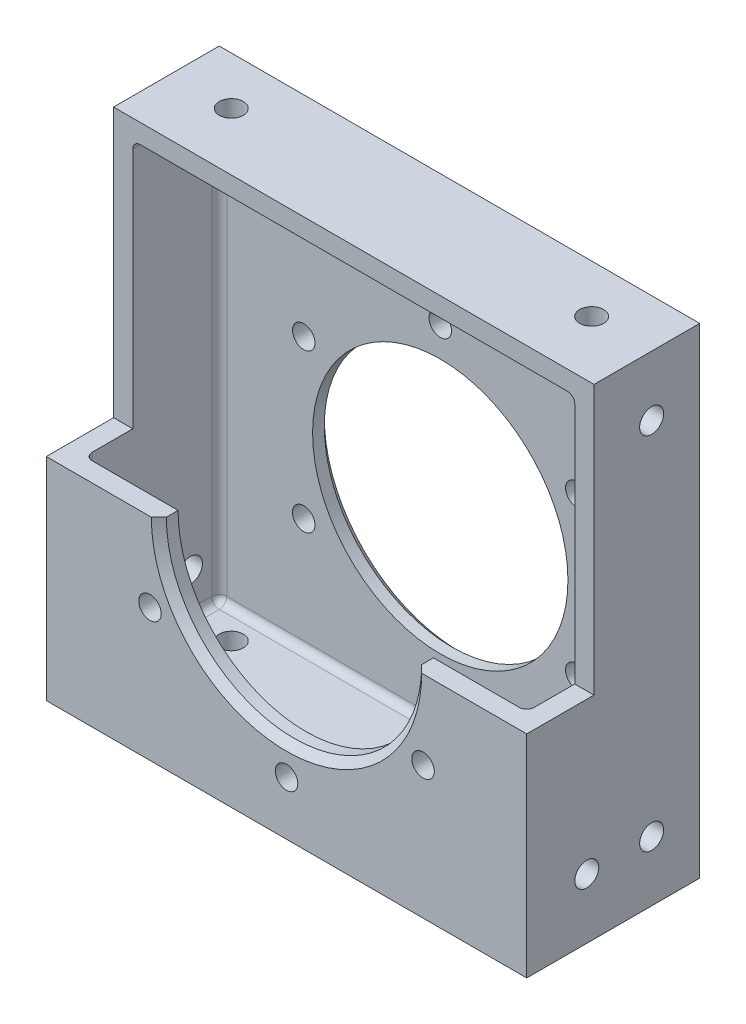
ISO-10303-21;
HEADER;
FILE_DESCRIPTION(('STEP AP214'),'2;1');
FILE_NAME('part.step','',(''),(''),'','','');
FILE_SCHEMA(('AUTOMOTIVE_DESIGN { 1 0 10303 214 1 1 1 1 }'));
ENDSEC;
DATA;
#1=APPLICATION_CONTEXT('core data for automotive mechanical design processes');
#2=APPLICATION_PROTOCOL_DEFINITION('international standard','automotive_design',2000,#1);
#3=PRODUCT_CONTEXT('',#1,'mechanical');
#4=PRODUCT('Part','Part','',(#3));
#5=PRODUCT_RELATED_PRODUCT_CATEGORY('part','',(#4));
#6=PRODUCT_DEFINITION_FORMATION('','',#4);
#7=PRODUCT_DEFINITION_CONTEXT('part definition',#1,'design');
#8=PRODUCT_DEFINITION('design','',#6,#7);
#9=PRODUCT_DEFINITION_SHAPE('','',#8);
#10=(LENGTH_UNIT() NAMED_UNIT(*) SI_UNIT(.MILLI.,.METRE.));
#11=(NAMED_UNIT(*) PLANE_ANGLE_UNIT() SI_UNIT($,.RADIAN.));
#12=(NAMED_UNIT(*) SI_UNIT($,.STERADIAN.) SOLID_ANGLE_UNIT());
#13=UNCERTAINTY_MEASURE_WITH_UNIT(LENGTH_MEASURE(1.E-05),#10,'distance_accuracy_value','');
#14=(GEOMETRIC_REPRESENTATION_CONTEXT(3) GLOBAL_UNCERTAINTY_ASSIGNED_CONTEXT((#13)) GLOBAL_UNIT_ASSIGNED_CONTEXT((#10,
#11,#12)) REPRESENTATION_CONTEXT('',''));
#15=CARTESIAN_POINT('',(0.,0.,0.));
#16=DIRECTION('',(0.,0.,1.));
#17=DIRECTION('',(1.,0.,0.));
#18=AXIS2_PLACEMENT_3D('',#15,#16,#17);
#19=CARTESIAN_POINT('',(-50.8,22.352,-7.112));
#20=DIRECTION('',(0.,1.,0.));
#21=DIRECTION('',(0.,0.,1.));
#22=AXIS2_PLACEMENT_3D('',#19,#20,#21);
#23=PLANE('',#22);
#24=DIRECTION('',(1.,0.,0.));
#25=VECTOR('',#24,1.);
#26=CARTESIAN_POINT('',(-50.8,22.352,0.));
#27=LINE('',#26,#25);
#28=CARTESIAN_POINT('',(-50.8,22.352,0.));
#29=VERTEX_POINT('',#28);
#30=CARTESIAN_POINT('',(-39.69385,22.352,0.));
#31=VERTEX_POINT('',#30);
#32=EDGE_CURVE('E272',#29,#31,#27,.T.);
#33=ORIENTED_EDGE('',*,*,#32,.T.);
#34=DIRECTION('',(-0.707106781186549,0.,0.707106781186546));
#35=VECTOR('',#34,1.);
#36=CARTESIAN_POINT('',(-25.4,22.352,-14.29385));
#37=LINE('',#36,#35);
#38=CARTESIAN_POINT('',(-38.9001,22.352,-0.793749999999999));
#39=VERTEX_POINT('',#38);
#40=EDGE_CURVE('E11',#31,#39,#37,.F.);
#41=ORIENTED_EDGE('',*,*,#40,.T.);
#42=DIRECTION('',(0.,0.,1.));
#43=VECTOR('',#42,1.);
#44=CARTESIAN_POINT('',(-38.9001,22.352,-18.288));
#45=LINE('',#44,#43);
#46=CARTESIAN_POINT('',(-38.9001,22.352,-2.032));
#47=VERTEX_POINT('',#46);
#48=EDGE_CURVE('E201',#47,#39,#45,.T.);
#49=ORIENTED_EDGE('',*,*,#48,.F.);
#50=DIRECTION('',(1.,0.,0.));
#51=VECTOR('',#50,1.);
#52=CARTESIAN_POINT('',(-50.8,22.352,-2.032));
#53=LINE('',#52,#51);
#54=CARTESIAN_POINT('',(-47.97425,22.352,-2.032));
#55=VERTEX_POINT('',#54);
#56=EDGE_CURVE('E181',#55,#47,#53,.T.);
#57=ORIENTED_EDGE('',*,*,#56,.F.);
#58=CARTESIAN_POINT('',(-47.97425,22.352,-2.82575));
#59=DIRECTION('',(0.,1.,0.));
#60=DIRECTION('',(0.,0.,1.));
#61=AXIS2_PLACEMENT_3D('',#58,#59,#60);
#62=CIRCLE('',#61,0.79375);
#63=CARTESIAN_POINT('',(-48.768,22.352,-2.82575));
#64=VERTEX_POINT('',#63);
#65=EDGE_CURVE('E351',#55,#64,#62,.F.);
#66=ORIENTED_EDGE('',*,*,#65,.T.);
#67=DIRECTION('',(0.,0.,1.));
#68=VECTOR('',#67,1.);
#69=CARTESIAN_POINT('',(-48.768,22.352,-7.112));
#70=LINE('',#69,#68);
#71=CARTESIAN_POINT('',(-48.768,22.352,-7.112));
#72=VERTEX_POINT('',#71);
#73=EDGE_CURVE('E222',#72,#64,#70,.T.);
#74=ORIENTED_EDGE('',*,*,#73,.F.);
#75=DIRECTION('',(1.,0.,0.));
#76=VECTOR('',#75,1.);
#77=CARTESIAN_POINT('',(-50.8,22.352,-7.112));
#78=LINE('',#77,#76);
#79=CARTESIAN_POINT('',(-50.8,22.352,-7.112));
#80=VERTEX_POINT('',#79);
#81=EDGE_CURVE('E275',#80,#72,#78,.T.);
#82=ORIENTED_EDGE('',*,*,#81,.F.);
#83=DIRECTION('',(0.,0.,1.));
#84=VECTOR('',#83,1.);
#85=CARTESIAN_POINT('',(-50.8,22.352,-7.112));
#86=LINE('',#85,#84);
#87=EDGE_CURVE('E249',#80,#29,#86,.T.);
#88=ORIENTED_EDGE('',*,*,#87,.T.);
#89=EDGE_LOOP('',(#33,#41,#49,#57,#66,#74,#82,#88));
#90=FACE_BOUND('',#89,.T.);
#91=ADVANCED_FACE('F28',(#90),#23,.T.);
#92=CARTESIAN_POINT('',(-50.8,22.352,-7.112));
#93=DIRECTION('',(0.,0.,1.));
#94=DIRECTION('',(1.,0.,0.));
#95=AXIS2_PLACEMENT_3D('',#92,#93,#94);
#96=PLANE('',#95);
#97=DIRECTION('',(0.,-1.,0.));
#98=VECTOR('',#97,1.);
#99=CARTESIAN_POINT('',(-48.768,22.352,-7.112));
#100=LINE('',#99,#98);
#101=CARTESIAN_POINT('',(-48.768,47.97425,-7.112));
#102=VERTEX_POINT('',#101);
#103=EDGE_CURVE('E220',#102,#72,#100,.T.);
#104=ORIENTED_EDGE('',*,*,#103,.F.);
#105=CARTESIAN_POINT('',(-47.97425,47.97425,-7.112));
#106=DIRECTION('',(0.,0.,1.));
#107=DIRECTION('',(1.,0.,0.));
#108=AXIS2_PLACEMENT_3D('',#105,#106,#107);
#109=CIRCLE('',#108,0.79375);
#110=CARTESIAN_POINT('',(-47.97425,48.768,-7.112));
#111=VERTEX_POINT('',#110);
#112=EDGE_CURVE('E395',#102,#111,#109,.F.);
#113=ORIENTED_EDGE('',*,*,#112,.T.);
#114=DIRECTION('',(1.,0.,0.));
#115=VECTOR('',#114,1.);
#116=CARTESIAN_POINT('',(-50.8,48.768,-7.112));
#117=LINE('',#116,#115);
#118=CARTESIAN_POINT('',(-2.82575,48.768,-7.112));
#119=VERTEX_POINT('',#118);
#120=EDGE_CURVE('E194',#111,#119,#117,.T.);
#121=ORIENTED_EDGE('',*,*,#120,.T.);
#122=CARTESIAN_POINT('',(-2.82575,47.97425,-7.112));
#123=DIRECTION('',(0.,0.,1.));
#124=DIRECTION('',(1.,0.,0.));
#125=AXIS2_PLACEMENT_3D('',#122,#123,#124);
#126=CIRCLE('',#125,0.79375);
#127=CARTESIAN_POINT('',(-2.032,47.97425,-7.112));
#128=VERTEX_POINT('',#127);
#129=EDGE_CURVE('E397',#119,#128,#126,.F.);
#130=ORIENTED_EDGE('',*,*,#129,.T.);
#131=DIRECTION('',(0.,-1.,0.));
#132=VECTOR('',#131,1.);
#133=CARTESIAN_POINT('',(-2.032,22.352,-7.112));
#134=LINE('',#133,#132);
#135=CARTESIAN_POINT('',(-2.032,22.352,-7.112));
#136=VERTEX_POINT('',#135);
#137=EDGE_CURVE('E211',#128,#136,#134,.T.);
#138=ORIENTED_EDGE('',*,*,#137,.T.);
#139=CARTESIAN_POINT('',(0.,22.352,-7.112));
#140=VERTEX_POINT('',#139);
#141=EDGE_CURVE('E264',#136,#140,#78,.T.);
#142=ORIENTED_EDGE('',*,*,#141,.T.);
#143=DIRECTION('',(0.,-1.,0.));
#144=VECTOR('',#143,1.);
#145=CARTESIAN_POINT('',(0.,22.352,-7.112));
#146=LINE('',#145,#144);
#147=CARTESIAN_POINT('',(0.,50.8,-7.112));
#148=VERTEX_POINT('',#147);
#149=EDGE_CURVE('E219',#148,#140,#146,.T.);
#150=ORIENTED_EDGE('',*,*,#149,.F.);
#151=DIRECTION('',(1.,0.,0.));
#152=VECTOR('',#151,1.);
#153=CARTESIAN_POINT('',(-50.8,50.8,-7.112));
#154=LINE('',#153,#152);
#155=CARTESIAN_POINT('',(-50.8,50.8,-7.112));
#156=VERTEX_POINT('',#155);
#157=EDGE_CURVE('E205',#156,#148,#154,.T.);
#158=ORIENTED_EDGE('',*,*,#157,.F.);
#159=DIRECTION('',(0.,-1.,0.));
#160=VECTOR('',#159,1.);
#161=CARTESIAN_POINT('',(-50.8,22.352,-7.112));
#162=LINE('',#161,#160);
#163=EDGE_CURVE('E246',#156,#80,#162,.T.);
#164=ORIENTED_EDGE('',*,*,#163,.T.);
#165=ORIENTED_EDGE('',*,*,#81,.T.);
#166=EDGE_LOOP('',(#104,#113,#121,#130,#138,#142,#150,#158,#164,#165));
#167=FACE_BOUND('',#166,.T.);
#168=ADVANCED_FACE('F30',(#167),#96,.T.);
#169=DIRECTION('',(0.,0.,1.));
#170=VECTOR('',#169,1.);
#171=CARTESIAN_POINT('',(-11.8999,22.352,-18.288));
#172=LINE('',#171,#170);
#173=CARTESIAN_POINT('',(-11.8999,22.352,-0.793749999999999));
#174=VERTEX_POINT('',#173);
#175=CARTESIAN_POINT('',(-11.8999,22.352,-2.032));
#176=VERTEX_POINT('',#175);
#177=EDGE_CURVE('E203',#174,#176,#172,.F.);
#178=ORIENTED_EDGE('',*,*,#177,.F.);
#179=DIRECTION('',(-0.707106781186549,0.,-0.707106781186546));
#180=VECTOR('',#179,1.);
#181=CARTESIAN_POINT('',(-25.4,22.352,-14.29385));
#182=LINE('',#181,#180);
#183=CARTESIAN_POINT('',(-11.10615,22.352,0.));
#184=VERTEX_POINT('',#183);
#185=EDGE_CURVE('E50',#174,#184,#182,.F.);
#186=ORIENTED_EDGE('',*,*,#185,.T.);
#187=CARTESIAN_POINT('',(0.,22.352,0.));
#188=VERTEX_POINT('',#187);
#189=EDGE_CURVE('E274',#184,#188,#27,.T.);
#190=ORIENTED_EDGE('',*,*,#189,.T.);
#191=DIRECTION('',(0.,0.,1.));
#192=VECTOR('',#191,1.);
#193=CARTESIAN_POINT('',(0.,22.352,-7.112));
#194=LINE('',#193,#192);
#195=EDGE_CURVE('E231',#140,#188,#194,.T.);
#196=ORIENTED_EDGE('',*,*,#195,.F.);
#197=ORIENTED_EDGE('',*,*,#141,.F.);
#198=DIRECTION('',(0.,0.,1.));
#199=VECTOR('',#198,1.);
#200=CARTESIAN_POINT('',(-2.032,22.352,-7.112));
#201=LINE('',#200,#199);
#202=CARTESIAN_POINT('',(-2.032,22.352,-2.82575));
#203=VERTEX_POINT('',#202);
#204=EDGE_CURVE('E223',#136,#203,#201,.T.);
#205=ORIENTED_EDGE('',*,*,#204,.T.);
#206=CARTESIAN_POINT('',(-2.82575,22.352,-2.82575));
#207=DIRECTION('',(0.,1.,0.));
#208=DIRECTION('',(0.,0.,1.));
#209=AXIS2_PLACEMENT_3D('',#206,#207,#208);
#210=CIRCLE('',#209,0.79375);
#211=CARTESIAN_POINT('',(-2.82575,22.352,-2.032));
#212=VERTEX_POINT('',#211);
#213=EDGE_CURVE('E349',#203,#212,#210,.F.);
#214=ORIENTED_EDGE('',*,*,#213,.T.);
#215=EDGE_CURVE('E195',#176,#212,#53,.T.);
#216=ORIENTED_EDGE('',*,*,#215,.F.);
#217=EDGE_LOOP('',(#178,#186,#190,#196,#197,#205,#214,#216));
#218=FACE_BOUND('',#217,.T.);
#219=ADVANCED_FACE('F408',(#218),#23,.T.);
#220=CARTESIAN_POINT('',(-50.8,50.8,-7.112));
#221=DIRECTION('',(0.,1.,0.));
#222=DIRECTION('',(0.,0.,1.));
#223=AXIS2_PLACEMENT_3D('',#220,#221,#222);
#224=PLANE('',#223);
#225=CARTESIAN_POINT('',(-6.34999999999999,50.8,-13.208));
#226=DIRECTION('',(0.,1.,0.));
#227=DIRECTION('',(0.,0.,1.));
#228=AXIS2_PLACEMENT_3D('',#225,#226,#227);
#229=CIRCLE('',#228,1.26999999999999);
#230=CARTESIAN_POINT('',(-6.34999999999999,50.8,-11.938));
#231=VERTEX_POINT('',#230);
#232=EDGE_CURVE('E477',#231,#231,#229,.T.);
#233=ORIENTED_EDGE('',*,*,#232,.F.);
#234=EDGE_LOOP('',(#233));
#235=FACE_BOUND('',#234,.T.);
#236=CARTESIAN_POINT('',(-44.45,50.8,-13.208));
#237=DIRECTION('',(0.,1.,0.));
#238=DIRECTION('',(0.,0.,1.));
#239=AXIS2_PLACEMENT_3D('',#236,#237,#238);
#240=CIRCLE('',#239,1.27);
#241=CARTESIAN_POINT('',(-44.45,50.8,-11.938));
#242=VERTEX_POINT('',#241);
#243=EDGE_CURVE('E484',#242,#242,#240,.T.);
#244=ORIENTED_EDGE('',*,*,#243,.F.);
#245=EDGE_LOOP('',(#244));
#246=FACE_BOUND('',#245,.T.);
#247=DIRECTION('',(0.,0.,1.));
#248=VECTOR('',#247,1.);
#249=CARTESIAN_POINT('',(0.,50.8,-7.112));
#250=LINE('',#249,#248);
#251=CARTESIAN_POINT('',(0.,50.8,-18.288));
#252=VERTEX_POINT('',#251);
#253=EDGE_CURVE('E243',#252,#148,#250,.T.);
#254=ORIENTED_EDGE('',*,*,#253,.F.);
#255=DIRECTION('',(1.,0.,0.));
#256=VECTOR('',#255,1.);
#257=CARTESIAN_POINT('',(-50.8,50.8,-18.288));
#258=LINE('',#257,#256);
#259=CARTESIAN_POINT('',(-50.8,50.8,-18.288));
#260=VERTEX_POINT('',#259);
#261=EDGE_CURVE('E266',#260,#252,#258,.T.);
#262=ORIENTED_EDGE('',*,*,#261,.F.);
#263=DIRECTION('',(0.,0.,1.));
#264=VECTOR('',#263,1.);
#265=CARTESIAN_POINT('',(-50.8,50.8,-7.112));
#266=LINE('',#265,#264);
#267=EDGE_CURVE('E261',#260,#156,#266,.T.);
#268=ORIENTED_EDGE('',*,*,#267,.T.);
#269=ORIENTED_EDGE('',*,*,#157,.T.);
#270=EDGE_LOOP('',(#254,#262,#268,#269));
#271=FACE_BOUND('',#270,.T.);
#272=ADVANCED_FACE('F540',(#235,#246,#271),#224,.T.);
#273=CARTESIAN_POINT('',(-50.8,50.8,-18.288));
#274=DIRECTION('',(0.,0.,-1.));
#275=DIRECTION('',(0.,1.,0.));
#276=AXIS2_PLACEMENT_3D('',#273,#274,#275);
#277=PLANE('',#276);
#278=CARTESIAN_POINT('',(-25.4,22.352,-18.288));
#279=DIRECTION('',(0.,0.,-1.));
#280=DIRECTION('',(0.,1.,0.));
#281=AXIS2_PLACEMENT_3D('',#278,#279,#280);
#282=CIRCLE('',#281,14.29385);
#283=CARTESIAN_POINT('',(-25.4,36.64585,-18.288));
#284=VERTEX_POINT('',#283);
#285=EDGE_CURVE('E399',#284,#284,#282,.F.);
#286=ORIENTED_EDGE('',*,*,#285,.T.);
#287=EDGE_LOOP('',(#286));
#288=FACE_BOUND('',#287,.T.);
#289=CARTESIAN_POINT('',(-39.8355609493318,14.0176249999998,-18.288));
#290=DIRECTION('',(0.,0.,-1.));
#291=DIRECTION('',(-0.50000000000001,0.866025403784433,0.));
#292=AXIS2_PLACEMENT_3D('',#289,#290,#291);
#293=CIRCLE('',#292,1.190625);
#294=CARTESIAN_POINT('',(-40.4308734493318,15.0487364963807,-18.288));
#295=VERTEX_POINT('',#294);
#296=EDGE_CURVE('E451',#295,#295,#293,.T.);
#297=ORIENTED_EDGE('',*,*,#296,.F.);
#298=EDGE_LOOP('',(#297));
#299=FACE_BOUND('',#298,.T.);
#300=CARTESIAN_POINT('',(-39.8355609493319,30.6863749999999,-18.288));
#301=DIRECTION('',(0.,0.,-1.));
#302=DIRECTION('',(0.499999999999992,0.866025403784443,0.));
#303=AXIS2_PLACEMENT_3D('',#300,#301,#302);
#304=CIRCLE('',#303,1.190625);
#305=CARTESIAN_POINT('',(-39.240248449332,31.7174864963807,-18.288));
#306=VERTEX_POINT('',#305);
#307=EDGE_CURVE('E324',#306,#306,#304,.T.);
#308=ORIENTED_EDGE('',*,*,#307,.F.);
#309=EDGE_LOOP('',(#308));
#310=FACE_BOUND('',#309,.T.);
#311=CARTESIAN_POINT('',(-25.4000000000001,39.02075,-18.288));
#312=DIRECTION('',(0.,0.,-1.));
#313=DIRECTION('',(1.,0.,0.));
#314=AXIS2_PLACEMENT_3D('',#311,#312,#313);
#315=CIRCLE('',#314,1.190625);
#316=CARTESIAN_POINT('',(-24.2093750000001,39.02075,-18.288));
#317=VERTEX_POINT('',#316);
#318=EDGE_CURVE('E320',#317,#317,#315,.T.);
#319=ORIENTED_EDGE('',*,*,#318,.F.);
#320=EDGE_LOOP('',(#319));
#321=FACE_BOUND('',#320,.T.);
#322=CARTESIAN_POINT('',(-10.9644390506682,30.6863750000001,-18.288));
#323=DIRECTION('',(0.,0.,-1.));
#324=DIRECTION('',(0.500000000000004,-0.866025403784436,0.));
#325=AXIS2_PLACEMENT_3D('',#322,#323,#324);
#326=CIRCLE('',#325,1.190625);
#327=CARTESIAN_POINT('',(-10.3691265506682,29.6552635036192,-18.288));
#328=VERTEX_POINT('',#327);
#329=EDGE_CURVE('E316',#328,#328,#326,.T.);
#330=ORIENTED_EDGE('',*,*,#329,.F.);
#331=EDGE_LOOP('',(#330));
#332=FACE_BOUND('',#331,.T.);
#333=CARTESIAN_POINT('',(-10.9644390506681,14.017625,-18.288));
#334=DIRECTION('',(0.,0.,-1.));
#335=DIRECTION('',(-0.499999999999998,-0.86602540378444,0.));
#336=AXIS2_PLACEMENT_3D('',#333,#334,#335);
#337=CIRCLE('',#336,1.190625);
#338=CARTESIAN_POINT('',(-11.5597515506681,12.9865135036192,-18.288));
#339=VERTEX_POINT('',#338);
#340=EDGE_CURVE('E315',#339,#339,#337,.T.);
#341=ORIENTED_EDGE('',*,*,#340,.F.);
#342=EDGE_LOOP('',(#341));
#343=FACE_BOUND('',#342,.T.);
#344=CARTESIAN_POINT('',(-25.4,5.68325,-18.288));
#345=DIRECTION('',(0.,0.,-1.));
#346=DIRECTION('',(-1.,0.,0.));
#347=AXIS2_PLACEMENT_3D('',#344,#345,#346);
#348=CIRCLE('',#347,1.190625);
#349=CARTESIAN_POINT('',(-26.590625,5.68325,-18.288));
#350=VERTEX_POINT('',#349);
#351=EDGE_CURVE('E470',#350,#350,#348,.T.);
#352=ORIENTED_EDGE('',*,*,#351,.F.);
#353=EDGE_LOOP('',(#352));
#354=FACE_BOUND('',#353,.T.);
#355=DIRECTION('',(0.,1.,0.));
#356=VECTOR('',#355,1.);
#357=CARTESIAN_POINT('',(0.,50.8,-18.288));
#358=LINE('',#357,#356);
#359=CARTESIAN_POINT('',(0.,0.,-18.288));
#360=VERTEX_POINT('',#359);
#361=EDGE_CURVE('E240',#360,#252,#358,.T.);
#362=ORIENTED_EDGE('',*,*,#361,.F.);
#363=DIRECTION('',(1.,0.,0.));
#364=VECTOR('',#363,1.);
#365=CARTESIAN_POINT('',(-50.8,0.,-18.288));
#366=LINE('',#365,#364);
#367=CARTESIAN_POINT('',(-50.8,0.,-18.288));
#368=VERTEX_POINT('',#367);
#369=EDGE_CURVE('E268',#368,#360,#366,.T.);
#370=ORIENTED_EDGE('',*,*,#369,.F.);
#371=DIRECTION('',(0.,1.,0.));
#372=VECTOR('',#371,1.);
#373=CARTESIAN_POINT('',(-50.8,50.8,-18.288));
#374=LINE('',#373,#372);
#375=EDGE_CURVE('E258',#368,#260,#374,.T.);
#376=ORIENTED_EDGE('',*,*,#375,.T.);
#377=ORIENTED_EDGE('',*,*,#261,.T.);
#378=EDGE_LOOP('',(#362,#370,#376,#377));
#379=FACE_BOUND('',#378,.T.);
#380=ADVANCED_FACE('F545',(#288,#299,#310,#321,#332,#343,#354,#379),#277,.T.);
#381=CARTESIAN_POINT('',(-50.8,0.,0.));
#382=DIRECTION('',(0.,-1.,0.));
#383=DIRECTION('',(0.,0.,-1.));
#384=AXIS2_PLACEMENT_3D('',#381,#382,#383);
#385=PLANE('',#384);
#386=CARTESIAN_POINT('',(-6.34999999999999,0.,-13.208));
#387=DIRECTION('',(0.,1.,0.));
#388=DIRECTION('',(0.,0.,1.));
#389=AXIS2_PLACEMENT_3D('',#386,#387,#388);
#390=CIRCLE('',#389,1.26999999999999);
#391=CARTESIAN_POINT('',(-6.34999999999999,0.,-11.938));
#392=VERTEX_POINT('',#391);
#393=EDGE_CURVE('E301',#392,#392,#390,.T.);
#394=ORIENTED_EDGE('',*,*,#393,.T.);
#395=EDGE_LOOP('',(#394));
#396=FACE_BOUND('',#395,.T.);
#397=CARTESIAN_POINT('',(-44.45,0.,-13.208));
#398=DIRECTION('',(0.,1.,0.));
#399=DIRECTION('',(0.,0.,1.));
#400=AXIS2_PLACEMENT_3D('',#397,#398,#399);
#401=CIRCLE('',#400,1.27);
#402=CARTESIAN_POINT('',(-44.45,0.,-11.938));
#403=VERTEX_POINT('',#402);
#404=EDGE_CURVE('E296',#403,#403,#401,.T.);
#405=ORIENTED_EDGE('',*,*,#404,.T.);
#406=EDGE_LOOP('',(#405));
#407=FACE_BOUND('',#406,.T.);
#408=DIRECTION('',(0.,0.,-1.));
#409=VECTOR('',#408,1.);
#410=CARTESIAN_POINT('',(0.,0.,0.));
#411=LINE('',#410,#409);
#412=CARTESIAN_POINT('',(0.,0.,0.));
#413=VERTEX_POINT('',#412);
#414=EDGE_CURVE('E237',#413,#360,#411,.T.);
#415=ORIENTED_EDGE('',*,*,#414,.F.);
#416=DIRECTION('',(1.,0.,0.));
#417=VECTOR('',#416,1.);
#418=CARTESIAN_POINT('',(-50.8,0.,0.));
#419=LINE('',#418,#417);
#420=CARTESIAN_POINT('',(-50.8,0.,0.));
#421=VERTEX_POINT('',#420);
#422=EDGE_CURVE('E270',#421,#413,#419,.T.);
#423=ORIENTED_EDGE('',*,*,#422,.F.);
#424=DIRECTION('',(0.,0.,-1.));
#425=VECTOR('',#424,1.);
#426=CARTESIAN_POINT('',(-50.8,0.,0.));
#427=LINE('',#426,#425);
#428=EDGE_CURVE('E255',#421,#368,#427,.T.);
#429=ORIENTED_EDGE('',*,*,#428,.T.);
#430=ORIENTED_EDGE('',*,*,#369,.T.);
#431=EDGE_LOOP('',(#415,#423,#429,#430));
#432=FACE_BOUND('',#431,.T.);
#433=ADVANCED_FACE('F552',(#396,#407,#432),#385,.T.);
#434=CARTESIAN_POINT('',(-50.8,22.352,0.));
#435=DIRECTION('',(0.,0.,1.));
#436=DIRECTION('',(0.,-1.,0.));
#437=AXIS2_PLACEMENT_3D('',#434,#435,#436);
#438=PLANE('',#437);
#439=CARTESIAN_POINT('',(-39.8355609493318,14.0176249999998,0.));
#440=DIRECTION('',(0.,0.,-1.));
#441=DIRECTION('',(-0.50000000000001,0.866025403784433,0.));
#442=AXIS2_PLACEMENT_3D('',#439,#440,#441);
#443=CIRCLE('',#442,1.190625);
#444=CARTESIAN_POINT('',(-40.4308734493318,15.0487364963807,0.));
#445=VERTEX_POINT('',#444);
#446=EDGE_CURVE('E329',#445,#445,#443,.T.);
#447=ORIENTED_EDGE('',*,*,#446,.T.);
#448=EDGE_LOOP('',(#447));
#449=FACE_BOUND('',#448,.T.);
#450=CARTESIAN_POINT('',(-10.9644390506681,14.017625,0.));
#451=DIRECTION('',(0.,0.,-1.));
#452=DIRECTION('',(-0.499999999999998,-0.86602540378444,0.));
#453=AXIS2_PLACEMENT_3D('',#450,#451,#452);
#454=CIRCLE('',#453,1.190625);
#455=CARTESIAN_POINT('',(-11.5597515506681,12.9865135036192,0.));
#456=VERTEX_POINT('',#455);
#457=EDGE_CURVE('E311',#456,#456,#454,.T.);
#458=ORIENTED_EDGE('',*,*,#457,.T.);
#459=EDGE_LOOP('',(#458));
#460=FACE_BOUND('',#459,.T.);
#461=CARTESIAN_POINT('',(-25.4,5.68325,0.));
#462=DIRECTION('',(0.,0.,-1.));
#463=DIRECTION('',(-1.,0.,0.));
#464=AXIS2_PLACEMENT_3D('',#461,#462,#463);
#465=CIRCLE('',#464,1.190625);
#466=CARTESIAN_POINT('',(-26.590625,5.68325,0.));
#467=VERTEX_POINT('',#466);
#468=EDGE_CURVE('E306',#467,#467,#465,.T.);
#469=ORIENTED_EDGE('',*,*,#468,.T.);
#470=EDGE_LOOP('',(#469));
#471=FACE_BOUND('',#470,.T.);
#472=ORIENTED_EDGE('',*,*,#189,.F.);
#473=CARTESIAN_POINT('',(-25.4,22.352,0.));
#474=DIRECTION('',(0.,0.,1.));
#475=DIRECTION('',(0.,-1.,0.));
#476=AXIS2_PLACEMENT_3D('',#473,#474,#475);
#477=CIRCLE('',#476,14.29385);
#478=EDGE_CURVE('E36',#184,#31,#477,.F.);
#479=ORIENTED_EDGE('',*,*,#478,.T.);
#480=ORIENTED_EDGE('',*,*,#32,.F.);
#481=DIRECTION('',(0.,-1.,0.));
#482=VECTOR('',#481,1.);
#483=CARTESIAN_POINT('',(-50.8,22.352,0.));
#484=LINE('',#483,#482);
#485=EDGE_CURVE('E252',#29,#421,#484,.T.);
#486=ORIENTED_EDGE('',*,*,#485,.T.);
#487=ORIENTED_EDGE('',*,*,#422,.T.);
#488=DIRECTION('',(0.,-1.,0.));
#489=VECTOR('',#488,1.);
#490=CARTESIAN_POINT('',(0.,22.352,0.));
#491=LINE('',#490,#489);
#492=EDGE_CURVE('E234',#188,#413,#491,.T.);
#493=ORIENTED_EDGE('',*,*,#492,.F.);
#494=EDGE_LOOP('',(#472,#479,#480,#486,#487,#493));
#495=FACE_BOUND('',#494,.T.);
#496=ADVANCED_FACE('F561',(#449,#460,#471,#495),#438,.T.);
#497=CARTESIAN_POINT('',(-50.8,50.8,-7.112));
#498=DIRECTION('',(-1.,0.,0.));
#499=DIRECTION('',(0.,0.,1.));
#500=AXIS2_PLACEMENT_3D('',#497,#498,#499);
#501=PLANE('',#500);
#502=CARTESIAN_POINT('',(-50.8,6.35,-6.35));
#503=DIRECTION('',(1.,0.,0.));
#504=DIRECTION('',(0.,0.,-1.));
#505=AXIS2_PLACEMENT_3D('',#502,#503,#504);
#506=CIRCLE('',#505,1.26999999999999);
#507=CARTESIAN_POINT('',(-50.8,6.35,-7.61999999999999));
#508=VERTEX_POINT('',#507);
#509=EDGE_CURVE('E291',#508,#508,#506,.T.);
#510=ORIENTED_EDGE('',*,*,#509,.T.);
#511=EDGE_LOOP('',(#510));
#512=FACE_BOUND('',#511,.T.);
#513=CARTESIAN_POINT('',(-50.8,6.35,-13.208));
#514=DIRECTION('',(1.,0.,0.));
#515=DIRECTION('',(0.,0.,-1.));
#516=AXIS2_PLACEMENT_3D('',#513,#514,#515);
#517=CIRCLE('',#516,1.26999999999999);
#518=CARTESIAN_POINT('',(-50.8,6.35,-14.478));
#519=VERTEX_POINT('',#518);
#520=EDGE_CURVE('E286',#519,#519,#517,.T.);
#521=ORIENTED_EDGE('',*,*,#520,.T.);
#522=EDGE_LOOP('',(#521));
#523=FACE_BOUND('',#522,.T.);
#524=CARTESIAN_POINT('',(-50.8,44.45,-13.208));
#525=DIRECTION('',(1.,0.,0.));
#526=DIRECTION('',(0.,0.,-1.));
#527=AXIS2_PLACEMENT_3D('',#524,#525,#526);
#528=CIRCLE('',#527,1.26999999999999);
#529=CARTESIAN_POINT('',(-50.8,44.45,-14.478));
#530=VERTEX_POINT('',#529);
#531=EDGE_CURVE('E281',#530,#530,#528,.T.);
#532=ORIENTED_EDGE('',*,*,#531,.T.);
#533=EDGE_LOOP('',(#532));
#534=FACE_BOUND('',#533,.T.);
#535=ORIENTED_EDGE('',*,*,#163,.F.);
#536=ORIENTED_EDGE('',*,*,#267,.F.);
#537=ORIENTED_EDGE('',*,*,#375,.F.);
#538=ORIENTED_EDGE('',*,*,#428,.F.);
#539=ORIENTED_EDGE('',*,*,#485,.F.);
#540=ORIENTED_EDGE('',*,*,#87,.F.);
#541=EDGE_LOOP('',(#535,#536,#537,#538,#539,#540));
#542=FACE_BOUND('',#541,.T.);
#543=ADVANCED_FACE('F558',(#512,#523,#534,#542),#501,.T.);
#544=CARTESIAN_POINT('',(0.,50.8,-7.112));
#545=DIRECTION('',(-1.,0.,0.));
#546=DIRECTION('',(0.,0.,1.));
#547=AXIS2_PLACEMENT_3D('',#544,#545,#546);
#548=PLANE('',#547);
#549=CARTESIAN_POINT('',(0.,6.35,-6.35));
#550=DIRECTION('',(1.,0.,0.));
#551=DIRECTION('',(0.,0.,-1.));
#552=AXIS2_PLACEMENT_3D('',#549,#550,#551);
#553=CIRCLE('',#552,1.26999999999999);
#554=CARTESIAN_POINT('',(0.,6.35,-7.61999999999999));
#555=VERTEX_POINT('',#554);
#556=EDGE_CURVE('E491',#555,#555,#553,.T.);
#557=ORIENTED_EDGE('',*,*,#556,.F.);
#558=EDGE_LOOP('',(#557));
#559=FACE_BOUND('',#558,.T.);
#560=CARTESIAN_POINT('',(0.,6.35,-13.208));
#561=DIRECTION('',(1.,0.,0.));
#562=DIRECTION('',(0.,0.,-1.));
#563=AXIS2_PLACEMENT_3D('',#560,#561,#562);
#564=CIRCLE('',#563,1.26999999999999);
#565=CARTESIAN_POINT('',(0.,6.35,-14.478));
#566=VERTEX_POINT('',#565);
#567=EDGE_CURVE('E498',#566,#566,#564,.T.);
#568=ORIENTED_EDGE('',*,*,#567,.F.);
#569=EDGE_LOOP('',(#568));
#570=FACE_BOUND('',#569,.T.);
#571=CARTESIAN_POINT('',(0.,44.45,-13.208));
#572=DIRECTION('',(1.,0.,0.));
#573=DIRECTION('',(0.,0.,-1.));
#574=AXIS2_PLACEMENT_3D('',#571,#572,#573);
#575=CIRCLE('',#574,1.26999999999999);
#576=CARTESIAN_POINT('',(0.,44.45,-14.478));
#577=VERTEX_POINT('',#576);
#578=EDGE_CURVE('E505',#577,#577,#575,.T.);
#579=ORIENTED_EDGE('',*,*,#578,.F.);
#580=EDGE_LOOP('',(#579));
#581=FACE_BOUND('',#580,.T.);
#582=ORIENTED_EDGE('',*,*,#149,.T.);
#583=ORIENTED_EDGE('',*,*,#195,.T.);
#584=ORIENTED_EDGE('',*,*,#492,.T.);
#585=ORIENTED_EDGE('',*,*,#414,.T.);
#586=ORIENTED_EDGE('',*,*,#361,.T.);
#587=ORIENTED_EDGE('',*,*,#253,.T.);
#588=EDGE_LOOP('',(#582,#583,#584,#585,#586,#587));
#589=FACE_BOUND('',#588,.T.);
#590=ADVANCED_FACE('F569',(#559,#570,#581,#589),#548,.F.);
#591=CARTESIAN_POINT('',(-50.8,48.768,-7.112));
#592=DIRECTION('',(0.,1.,0.));
#593=DIRECTION('',(0.,0.,1.));
#594=AXIS2_PLACEMENT_3D('',#591,#592,#593);
#595=PLANE('',#594);
#596=ORIENTED_EDGE('',*,*,#120,.F.);
#597=DIRECTION('',(0.,0.,1.));
#598=VECTOR('',#597,1.);
#599=CARTESIAN_POINT('',(-47.97425,48.768,-15.46225));
#600=LINE('',#599,#598);
#601=CARTESIAN_POINT('',(-47.97425,48.768,-15.46225));
#602=VERTEX_POINT('',#601);
#603=EDGE_CURVE('E377',#111,#602,#600,.F.);
#604=ORIENTED_EDGE('',*,*,#603,.T.);
#605=DIRECTION('',(1.,0.,0.));
#606=VECTOR('',#605,1.);
#607=CARTESIAN_POINT('',(-2.82575,48.768,-15.46225));
#608=LINE('',#607,#606);
#609=CARTESIAN_POINT('',(-2.82575,48.768,-15.46225));
#610=VERTEX_POINT('',#609);
#611=EDGE_CURVE('E373',#602,#610,#608,.T.);
#612=ORIENTED_EDGE('',*,*,#611,.T.);
#613=DIRECTION('',(0.,0.,1.));
#614=VECTOR('',#613,1.);
#615=CARTESIAN_POINT('',(-2.82575,48.768,-7.112));
#616=LINE('',#615,#614);
#617=EDGE_CURVE('E375',#610,#119,#616,.T.);
#618=ORIENTED_EDGE('',*,*,#617,.T.);
#619=EDGE_LOOP('',(#596,#604,#612,#618));
#620=FACE_BOUND('',#619,.T.);
#621=CARTESIAN_POINT('',(-6.34999999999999,48.768,-13.208));
#622=DIRECTION('',(0.,1.,0.));
#623=DIRECTION('',(0.,0.,1.));
#624=AXIS2_PLACEMENT_3D('',#621,#622,#623);
#625=CIRCLE('',#624,1.26999999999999);
#626=CARTESIAN_POINT('',(-6.34999999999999,48.768,-11.938));
#627=VERTEX_POINT('',#626);
#628=EDGE_CURVE('E300',#627,#627,#625,.T.);
#629=ORIENTED_EDGE('',*,*,#628,.T.);
#630=EDGE_LOOP('',(#629));
#631=FACE_BOUND('',#630,.T.);
#632=CARTESIAN_POINT('',(-44.45,48.768,-13.208));
#633=DIRECTION('',(0.,1.,0.));
#634=DIRECTION('',(0.,0.,1.));
#635=AXIS2_PLACEMENT_3D('',#632,#633,#634);
#636=CIRCLE('',#635,1.27);
#637=CARTESIAN_POINT('',(-44.45,48.768,-11.938));
#638=VERTEX_POINT('',#637);
#639=EDGE_CURVE('E295',#638,#638,#636,.T.);
#640=ORIENTED_EDGE('',*,*,#639,.T.);
#641=EDGE_LOOP('',(#640));
#642=FACE_BOUND('',#641,.T.);
#643=ADVANCED_FACE('F702',(#620,#631,#642),#595,.F.);
#644=CARTESIAN_POINT('',(-50.8,50.8,-16.256));
#645=DIRECTION('',(0.,0.,-1.));
#646=DIRECTION('',(0.,1.,0.));
#647=AXIS2_PLACEMENT_3D('',#644,#645,#646);
#648=PLANE('',#647);
#649=CARTESIAN_POINT('',(-39.8355609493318,14.0176249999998,-16.256));
#650=DIRECTION('',(0.,0.,-1.));
#651=DIRECTION('',(0.,1.,0.));
#652=AXIS2_PLACEMENT_3D('',#649,#650,#651);
#653=CIRCLE('',#652,1.190625);
#654=CARTESIAN_POINT('',(-39.8355609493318,15.2082499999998,-16.256));
#655=VERTEX_POINT('',#654);
#656=EDGE_CURVE('E328',#655,#655,#653,.T.);
#657=ORIENTED_EDGE('',*,*,#656,.T.);
#658=EDGE_LOOP('',(#657));
#659=FACE_BOUND('',#658,.T.);
#660=CARTESIAN_POINT('',(-39.8355609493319,30.6863749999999,-16.256));
#661=DIRECTION('',(0.,0.,-1.));
#662=DIRECTION('',(0.,1.,0.));
#663=AXIS2_PLACEMENT_3D('',#660,#661,#662);
#664=CIRCLE('',#663,1.190625);
#665=CARTESIAN_POINT('',(-39.8355609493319,31.8769999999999,-16.256));
#666=VERTEX_POINT('',#665);
#667=EDGE_CURVE('E321',#666,#666,#664,.T.);
#668=ORIENTED_EDGE('',*,*,#667,.T.);
#669=EDGE_LOOP('',(#668));
#670=FACE_BOUND('',#669,.T.);
#671=CARTESIAN_POINT('',(-25.4000000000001,39.02075,-16.256));
#672=DIRECTION('',(0.,0.,-1.));
#673=DIRECTION('',(0.,1.,0.));
#674=AXIS2_PLACEMENT_3D('',#671,#672,#673);
#675=CIRCLE('',#674,1.190625);
#676=CARTESIAN_POINT('',(-25.4000000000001,40.211375,-16.256));
#677=VERTEX_POINT('',#676);
#678=EDGE_CURVE('E317',#677,#677,#675,.T.);
#679=ORIENTED_EDGE('',*,*,#678,.T.);
#680=EDGE_LOOP('',(#679));
#681=FACE_BOUND('',#680,.T.);
#682=CARTESIAN_POINT('',(-10.9644390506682,30.6863750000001,-16.256));
#683=DIRECTION('',(0.,0.,-1.));
#684=DIRECTION('',(0.,1.,0.));
#685=AXIS2_PLACEMENT_3D('',#682,#683,#684);
#686=CIRCLE('',#685,1.190625);
#687=CARTESIAN_POINT('',(-10.9644390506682,31.8770000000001,-16.256));
#688=VERTEX_POINT('',#687);
#689=EDGE_CURVE('E312',#688,#688,#686,.T.);
#690=ORIENTED_EDGE('',*,*,#689,.T.);
#691=EDGE_LOOP('',(#690));
#692=FACE_BOUND('',#691,.T.);
#693=CARTESIAN_POINT('',(-10.9644390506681,14.017625,-16.256));
#694=DIRECTION('',(0.,0.,-1.));
#695=DIRECTION('',(0.,1.,0.));
#696=AXIS2_PLACEMENT_3D('',#693,#694,#695);
#697=CIRCLE('',#696,1.190625);
#698=CARTESIAN_POINT('',(-10.9644390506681,15.20825,-16.256));
#699=VERTEX_POINT('',#698);
#700=EDGE_CURVE('E310',#699,#699,#697,.T.);
#701=ORIENTED_EDGE('',*,*,#700,.T.);
#702=EDGE_LOOP('',(#701));
#703=FACE_BOUND('',#702,.T.);
#704=CARTESIAN_POINT('',(-25.4,5.68325,-16.256));
#705=DIRECTION('',(0.,0.,-1.));
#706=DIRECTION('',(0.,1.,0.));
#707=AXIS2_PLACEMENT_3D('',#704,#705,#706);
#708=CIRCLE('',#707,1.190625);
#709=CARTESIAN_POINT('',(-25.4,6.87387500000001,-16.256));
#710=VERTEX_POINT('',#709);
#711=EDGE_CURVE('E305',#710,#710,#708,.T.);
#712=ORIENTED_EDGE('',*,*,#711,.T.);
#713=EDGE_LOOP('',(#712));
#714=FACE_BOUND('',#713,.T.);
#715=CARTESIAN_POINT('',(-25.4,22.352,-16.256));
#716=DIRECTION('',(0.,0.,-1.));
#717=DIRECTION('',(0.,1.,0.));
#718=AXIS2_PLACEMENT_3D('',#715,#716,#717);
#719=CIRCLE('',#718,13.5001);
#720=CARTESIAN_POINT('',(-25.4,35.8521,-16.256));
#721=VERTEX_POINT('',#720);
#722=EDGE_CURVE('E208',#721,#721,#719,.T.);
#723=ORIENTED_EDGE('',*,*,#722,.T.);
#724=EDGE_LOOP('',(#723));
#725=FACE_BOUND('',#724,.T.);
#726=DIRECTION('',(0.,1.,0.));
#727=VECTOR('',#726,1.);
#728=CARTESIAN_POINT('',(-2.82575,50.8,-16.256));
#729=LINE('',#728,#727);
#730=CARTESIAN_POINT('',(-2.82575,2.82575,-16.256));
#731=VERTEX_POINT('',#730);
#732=CARTESIAN_POINT('',(-2.82575,47.97425,-16.256));
#733=VERTEX_POINT('',#732);
#734=EDGE_CURVE('E335',#731,#733,#729,.T.);
#735=ORIENTED_EDGE('',*,*,#734,.T.);
#736=DIRECTION('',(1.,0.,0.));
#737=VECTOR('',#736,1.);
#738=CARTESIAN_POINT('',(-47.97425,47.97425,-16.256));
#739=LINE('',#738,#737);
#740=CARTESIAN_POINT('',(-47.97425,47.97425,-16.256));
#741=VERTEX_POINT('',#740);
#742=EDGE_CURVE('E393',#733,#741,#739,.F.);
#743=ORIENTED_EDGE('',*,*,#742,.T.);
#744=DIRECTION('',(0.,1.,0.));
#745=VECTOR('',#744,1.);
#746=CARTESIAN_POINT('',(-47.97425,2.032,-16.256));
#747=LINE('',#746,#745);
#748=CARTESIAN_POINT('',(-47.97425,2.82575,-16.256));
#749=VERTEX_POINT('',#748);
#750=EDGE_CURVE('E338',#741,#749,#747,.F.);
#751=ORIENTED_EDGE('',*,*,#750,.T.);
#752=DIRECTION('',(1.,0.,0.));
#753=VECTOR('',#752,1.);
#754=CARTESIAN_POINT('',(-2.82575,2.82575,-16.256));
#755=LINE('',#754,#753);
#756=EDGE_CURVE('E391',#749,#731,#755,.T.);
#757=ORIENTED_EDGE('',*,*,#756,.T.);
#758=EDGE_LOOP('',(#735,#743,#751,#757));
#759=FACE_BOUND('',#758,.T.);
#760=ADVANCED_FACE('F774',(#659,#670,#681,#692,#703,#714,#725,#759),#648,.F.);
#761=CARTESIAN_POINT('',(-50.8,2.032,0.));
#762=DIRECTION('',(0.,-1.,0.));
#763=DIRECTION('',(0.,0.,-1.));
#764=AXIS2_PLACEMENT_3D('',#761,#762,#763);
#765=PLANE('',#764);
#766=DIRECTION('',(0.,0.,-1.));
#767=VECTOR('',#766,1.);
#768=CARTESIAN_POINT('',(-47.97425,2.032,-2.82575));
#769=LINE('',#768,#767);
#770=CARTESIAN_POINT('',(-47.97425,2.032,-15.46225));
#771=VERTEX_POINT('',#770);
#772=CARTESIAN_POINT('',(-47.97425,2.032,-2.82575));
#773=VERTEX_POINT('',#772);
#774=EDGE_CURVE('E357',#771,#773,#769,.F.);
#775=ORIENTED_EDGE('',*,*,#774,.T.);
#776=DIRECTION('',(1.,0.,0.));
#777=VECTOR('',#776,1.);
#778=CARTESIAN_POINT('',(-2.82575,2.032,-2.82575));
#779=LINE('',#778,#777);
#780=CARTESIAN_POINT('',(-2.82575,2.032,-2.82575));
#781=VERTEX_POINT('',#780);
#782=EDGE_CURVE('E359',#773,#781,#779,.T.);
#783=ORIENTED_EDGE('',*,*,#782,.T.);
#784=DIRECTION('',(0.,0.,-1.));
#785=VECTOR('',#784,1.);
#786=CARTESIAN_POINT('',(-2.82575,2.032,0.));
#787=LINE('',#786,#785);
#788=CARTESIAN_POINT('',(-2.82575,2.032,-15.46225));
#789=VERTEX_POINT('',#788);
#790=EDGE_CURVE('E355',#781,#789,#787,.T.);
#791=ORIENTED_EDGE('',*,*,#790,.T.);
#792=DIRECTION('',(1.,0.,0.));
#793=VECTOR('',#792,1.);
#794=CARTESIAN_POINT('',(-47.97425,2.032,-15.46225));
#795=LINE('',#794,#793);
#796=EDGE_CURVE('E353',#789,#771,#795,.F.);
#797=ORIENTED_EDGE('',*,*,#796,.T.);
#798=EDGE_LOOP('',(#775,#783,#791,#797));
#799=FACE_BOUND('',#798,.T.);
#800=CARTESIAN_POINT('',(-6.34999999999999,2.032,-13.208));
#801=DIRECTION('',(0.,-1.,0.));
#802=DIRECTION('',(0.,0.,-1.));
#803=AXIS2_PLACEMENT_3D('',#800,#801,#802);
#804=CIRCLE('',#803,1.26999999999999);
#805=CARTESIAN_POINT('',(-6.34999999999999,2.032,-11.938));
#806=VERTEX_POINT('',#805);
#807=EDGE_CURVE('E297',#806,#806,#804,.T.);
#808=ORIENTED_EDGE('',*,*,#807,.T.);
#809=EDGE_LOOP('',(#808));
#810=FACE_BOUND('',#809,.T.);
#811=CARTESIAN_POINT('',(-44.45,2.032,-13.208));
#812=DIRECTION('',(0.,-1.,0.));
#813=DIRECTION('',(0.,0.,-1.));
#814=AXIS2_PLACEMENT_3D('',#811,#812,#813);
#815=CIRCLE('',#814,1.27);
#816=CARTESIAN_POINT('',(-44.45,2.032,-11.938));
#817=VERTEX_POINT('',#816);
#818=EDGE_CURVE('E292',#817,#817,#815,.T.);
#819=ORIENTED_EDGE('',*,*,#818,.T.);
#820=EDGE_LOOP('',(#819));
#821=FACE_BOUND('',#820,.T.);
#822=ADVANCED_FACE('F722',(#799,#810,#821),#765,.F.);
#823=CARTESIAN_POINT('',(-50.8,22.352,-2.032));
#824=DIRECTION('',(0.,0.,1.));
#825=DIRECTION('',(0.,-1.,0.));
#826=AXIS2_PLACEMENT_3D('',#823,#824,#825);
#827=PLANE('',#826);
#828=CARTESIAN_POINT('',(-39.8355609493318,14.0176249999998,-2.032));
#829=DIRECTION('',(0.,0.,1.));
#830=DIRECTION('',(0.,-1.,0.));
#831=AXIS2_PLACEMENT_3D('',#828,#829,#830);
#832=CIRCLE('',#831,1.190625);
#833=CARTESIAN_POINT('',(-39.8355609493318,12.8269999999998,-2.032));
#834=VERTEX_POINT('',#833);
#835=EDGE_CURVE('E325',#834,#834,#832,.T.);
#836=ORIENTED_EDGE('',*,*,#835,.T.);
#837=EDGE_LOOP('',(#836));
#838=FACE_BOUND('',#837,.T.);
#839=CARTESIAN_POINT('',(-10.9644390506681,14.017625,-2.032));
#840=DIRECTION('',(0.,0.,1.));
#841=DIRECTION('',(0.,-1.,0.));
#842=AXIS2_PLACEMENT_3D('',#839,#840,#841);
#843=CIRCLE('',#842,1.190625);
#844=CARTESIAN_POINT('',(-10.9644390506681,12.827,-2.032));
#845=VERTEX_POINT('',#844);
#846=EDGE_CURVE('E307',#845,#845,#843,.T.);
#847=ORIENTED_EDGE('',*,*,#846,.T.);
#848=EDGE_LOOP('',(#847));
#849=FACE_BOUND('',#848,.T.);
#850=CARTESIAN_POINT('',(-25.4,5.68325,-2.032));
#851=DIRECTION('',(0.,0.,1.));
#852=DIRECTION('',(0.,-1.,0.));
#853=AXIS2_PLACEMENT_3D('',#850,#851,#852);
#854=CIRCLE('',#853,1.190625);
#855=CARTESIAN_POINT('',(-25.4,4.492625,-2.032));
#856=VERTEX_POINT('',#855);
#857=EDGE_CURVE('E302',#856,#856,#854,.T.);
#858=ORIENTED_EDGE('',*,*,#857,.T.);
#859=EDGE_LOOP('',(#858));
#860=FACE_BOUND('',#859,.T.);
#861=DIRECTION('',(0.,-1.,0.));
#862=VECTOR('',#861,1.);
#863=CARTESIAN_POINT('',(-2.82575,22.352,-2.032));
#864=LINE('',#863,#862);
#865=CARTESIAN_POINT('',(-2.82575,2.82575,-2.032));
#866=VERTEX_POINT('',#865);
#867=EDGE_CURVE('E347',#212,#866,#864,.T.);
#868=ORIENTED_EDGE('',*,*,#867,.T.);
#869=DIRECTION('',(1.,0.,0.));
#870=VECTOR('',#869,1.);
#871=CARTESIAN_POINT('',(-47.97425,2.82575,-2.032));
#872=LINE('',#871,#870);
#873=CARTESIAN_POINT('',(-47.97425,2.82575,-2.032));
#874=VERTEX_POINT('',#873);
#875=EDGE_CURVE('E362',#866,#874,#872,.F.);
#876=ORIENTED_EDGE('',*,*,#875,.T.);
#877=DIRECTION('',(0.,-1.,0.));
#878=VECTOR('',#877,1.);
#879=CARTESIAN_POINT('',(-47.97425,22.352,-2.032));
#880=LINE('',#879,#878);
#881=EDGE_CURVE('E190',#874,#55,#880,.F.);
#882=ORIENTED_EDGE('',*,*,#881,.T.);
#883=ORIENTED_EDGE('',*,*,#56,.T.);
#884=CARTESIAN_POINT('',(-25.4,22.352,-2.032));
#885=DIRECTION('',(0.,0.,1.));
#886=DIRECTION('',(0.,-1.,0.));
#887=AXIS2_PLACEMENT_3D('',#884,#885,#886);
#888=CIRCLE('',#887,13.5001);
#889=EDGE_CURVE('E186',#47,#176,#888,.T.);
#890=ORIENTED_EDGE('',*,*,#889,.T.);
#891=ORIENTED_EDGE('',*,*,#215,.T.);
#892=EDGE_LOOP('',(#868,#876,#882,#883,#890,#891));
#893=FACE_BOUND('',#892,.T.);
#894=ADVANCED_FACE('F184',(#838,#849,#860,#893),#827,.F.);
#895=CARTESIAN_POINT('',(-48.768,50.8,-7.112));
#896=DIRECTION('',(-1.,0.,0.));
#897=DIRECTION('',(0.,0.,1.));
#898=AXIS2_PLACEMENT_3D('',#895,#896,#897);
#899=PLANE('',#898);
#900=CARTESIAN_POINT('',(-48.768,6.35,-6.35));
#901=DIRECTION('',(-1.,0.,0.));
#902=DIRECTION('',(0.,0.,1.));
#903=AXIS2_PLACEMENT_3D('',#900,#901,#902);
#904=CIRCLE('',#903,1.26999999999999);
#905=CARTESIAN_POINT('',(-48.768,6.35,-5.08000000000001));
#906=VERTEX_POINT('',#905);
#907=EDGE_CURVE('E290',#906,#906,#904,.T.);
#908=ORIENTED_EDGE('',*,*,#907,.T.);
#909=EDGE_LOOP('',(#908));
#910=FACE_BOUND('',#909,.T.);
#911=CARTESIAN_POINT('',(-48.768,6.35,-13.208));
#912=DIRECTION('',(-1.,0.,0.));
#913=DIRECTION('',(0.,0.,1.));
#914=AXIS2_PLACEMENT_3D('',#911,#912,#913);
#915=CIRCLE('',#914,1.26999999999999);
#916=CARTESIAN_POINT('',(-48.768,6.35,-11.938));
#917=VERTEX_POINT('',#916);
#918=EDGE_CURVE('E285',#917,#917,#915,.T.);
#919=ORIENTED_EDGE('',*,*,#918,.T.);
#920=EDGE_LOOP('',(#919));
#921=FACE_BOUND('',#920,.T.);
#922=CARTESIAN_POINT('',(-48.768,44.45,-13.208));
#923=DIRECTION('',(-1.,0.,0.));
#924=DIRECTION('',(0.,0.,1.));
#925=AXIS2_PLACEMENT_3D('',#922,#923,#924);
#926=CIRCLE('',#925,1.26999999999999);
#927=CARTESIAN_POINT('',(-48.768,44.45,-11.938));
#928=VERTEX_POINT('',#927);
#929=EDGE_CURVE('E213',#928,#928,#926,.T.);
#930=ORIENTED_EDGE('',*,*,#929,.T.);
#931=EDGE_LOOP('',(#930));
#932=FACE_BOUND('',#931,.T.);
#933=DIRECTION('',(0.,1.,0.));
#934=VECTOR('',#933,1.);
#935=CARTESIAN_POINT('',(-48.768,48.768,-15.46225));
#936=LINE('',#935,#934);
#937=CARTESIAN_POINT('',(-48.768,2.82575,-15.46225));
#938=VERTEX_POINT('',#937);
#939=CARTESIAN_POINT('',(-48.768,47.97425,-15.46225));
#940=VERTEX_POINT('',#939);
#941=EDGE_CURVE('E332',#938,#940,#936,.T.);
#942=ORIENTED_EDGE('',*,*,#941,.T.);
#943=DIRECTION('',(0.,0.,1.));
#944=VECTOR('',#943,1.);
#945=CARTESIAN_POINT('',(-48.768,47.97425,-7.112));
#946=LINE('',#945,#944);
#947=EDGE_CURVE('E370',#940,#102,#946,.T.);
#948=ORIENTED_EDGE('',*,*,#947,.T.);
#949=ORIENTED_EDGE('',*,*,#103,.T.);
#950=ORIENTED_EDGE('',*,*,#73,.T.);
#951=DIRECTION('',(0.,-1.,0.));
#952=VECTOR('',#951,1.);
#953=CARTESIAN_POINT('',(-48.768,2.032,-2.82575));
#954=LINE('',#953,#952);
#955=CARTESIAN_POINT('',(-48.768,2.82575,-2.82575));
#956=VERTEX_POINT('',#955);
#957=EDGE_CURVE('E204',#64,#956,#954,.T.);
#958=ORIENTED_EDGE('',*,*,#957,.T.);
#959=DIRECTION('',(0.,0.,-1.));
#960=VECTOR('',#959,1.);
#961=CARTESIAN_POINT('',(-48.768,2.82575,-15.46225));
#962=LINE('',#961,#960);
#963=EDGE_CURVE('E368',#956,#938,#962,.T.);
#964=ORIENTED_EDGE('',*,*,#963,.T.);
#965=EDGE_LOOP('',(#942,#948,#949,#950,#958,#964));
#966=FACE_BOUND('',#965,.T.);
#967=ADVANCED_FACE('F512',(#910,#921,#932,#966),#899,.F.);
#968=CARTESIAN_POINT('',(-2.032,50.8,-7.112));
#969=DIRECTION('',(-1.,0.,0.));
#970=DIRECTION('',(0.,0.,1.));
#971=AXIS2_PLACEMENT_3D('',#968,#969,#970);
#972=PLANE('',#971);
#973=CARTESIAN_POINT('',(-2.032,6.35,-6.35));
#974=DIRECTION('',(-1.,0.,0.));
#975=DIRECTION('',(0.,0.,1.));
#976=AXIS2_PLACEMENT_3D('',#973,#974,#975);
#977=CIRCLE('',#976,1.26999999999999);
#978=CARTESIAN_POINT('',(-2.032,6.35,-5.08000000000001));
#979=VERTEX_POINT('',#978);
#980=EDGE_CURVE('E287',#979,#979,#977,.T.);
#981=ORIENTED_EDGE('',*,*,#980,.F.);
#982=EDGE_LOOP('',(#981));
#983=FACE_BOUND('',#982,.T.);
#984=CARTESIAN_POINT('',(-2.032,6.35,-13.208));
#985=DIRECTION('',(-1.,0.,0.));
#986=DIRECTION('',(0.,0.,1.));
#987=AXIS2_PLACEMENT_3D('',#984,#985,#986);
#988=CIRCLE('',#987,1.26999999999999);
#989=CARTESIAN_POINT('',(-2.032,6.35,-11.938));
#990=VERTEX_POINT('',#989);
#991=EDGE_CURVE('E282',#990,#990,#988,.T.);
#992=ORIENTED_EDGE('',*,*,#991,.F.);
#993=EDGE_LOOP('',(#992));
#994=FACE_BOUND('',#993,.T.);
#995=CARTESIAN_POINT('',(-2.032,44.45,-13.208));
#996=DIRECTION('',(-1.,0.,0.));
#997=DIRECTION('',(0.,0.,1.));
#998=AXIS2_PLACEMENT_3D('',#995,#996,#997);
#999=CIRCLE('',#998,1.26999999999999);
#1000=CARTESIAN_POINT('',(-2.032,44.45,-11.938));
#1001=VERTEX_POINT('',#1000);
#1002=EDGE_CURVE('E278',#1001,#1001,#999,.T.);
#1003=ORIENTED_EDGE('',*,*,#1002,.F.);
#1004=EDGE_LOOP('',(#1003));
#1005=FACE_BOUND('',#1004,.T.);
#1006=ORIENTED_EDGE('',*,*,#137,.F.);
#1007=DIRECTION('',(0.,0.,1.));
#1008=VECTOR('',#1007,1.);
#1009=CARTESIAN_POINT('',(-2.032,47.97425,-7.112));
#1010=LINE('',#1009,#1008);
#1011=CARTESIAN_POINT('',(-2.032,47.97425,-15.46225));
#1012=VERTEX_POINT('',#1011);
#1013=EDGE_CURVE('E381',#128,#1012,#1010,.F.);
#1014=ORIENTED_EDGE('',*,*,#1013,.T.);
#1015=DIRECTION('',(0.,1.,0.));
#1016=VECTOR('',#1015,1.);
#1017=CARTESIAN_POINT('',(-2.032,50.8,-15.46225));
#1018=LINE('',#1017,#1016);
#1019=CARTESIAN_POINT('',(-2.032,2.82575,-15.46225));
#1020=VERTEX_POINT('',#1019);
#1021=EDGE_CURVE('E343',#1012,#1020,#1018,.F.);
#1022=ORIENTED_EDGE('',*,*,#1021,.T.);
#1023=DIRECTION('',(0.,0.,-1.));
#1024=VECTOR('',#1023,1.);
#1025=CARTESIAN_POINT('',(-2.032,2.82575,-7.112));
#1026=LINE('',#1025,#1024);
#1027=CARTESIAN_POINT('',(-2.032,2.82575,-2.82575));
#1028=VERTEX_POINT('',#1027);
#1029=EDGE_CURVE('E379',#1020,#1028,#1026,.F.);
#1030=ORIENTED_EDGE('',*,*,#1029,.T.);
#1031=DIRECTION('',(0.,-1.,0.));
#1032=VECTOR('',#1031,1.);
#1033=CARTESIAN_POINT('',(-2.032,50.8,-2.82574999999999));
#1034=LINE('',#1033,#1032);
#1035=EDGE_CURVE('E341',#1028,#203,#1034,.F.);
#1036=ORIENTED_EDGE('',*,*,#1035,.T.);
#1037=ORIENTED_EDGE('',*,*,#204,.F.);
#1038=EDGE_LOOP('',(#1006,#1014,#1022,#1030,#1036,#1037));
#1039=FACE_BOUND('',#1038,.T.);
#1040=ADVANCED_FACE('F715',(#983,#994,#1005,#1039),#972,.T.);
#1041=CARTESIAN_POINT('',(-25.4,22.352,-18.288));
#1042=DIRECTION('',(0.,0.,1.));
#1043=DIRECTION('',(1.,0.,0.));
#1044=AXIS2_PLACEMENT_3D('',#1041,#1042,#1043);
#1045=CYLINDRICAL_SURFACE('',#1044,13.5001);
#1046=ORIENTED_EDGE('',*,*,#48,.T.);
#1047=CARTESIAN_POINT('',(-25.4,22.352,-0.793749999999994));
#1048=DIRECTION('',(0.,0.,1.));
#1049=DIRECTION('',(1.,0.,0.));
#1050=AXIS2_PLACEMENT_3D('',#1047,#1048,#1049);
#1051=CIRCLE('',#1050,13.5001);
#1052=EDGE_CURVE('E405',#39,#174,#1051,.T.);
#1053=ORIENTED_EDGE('',*,*,#1052,.T.);
#1054=ORIENTED_EDGE('',*,*,#177,.T.);
#1055=ORIENTED_EDGE('',*,*,#889,.F.);
#1056=EDGE_LOOP('',(#1046,#1053,#1054,#1055));
#1057=FACE_BOUND('',#1056,.T.);
#1058=ADVANCED_FACE('F199',(#1057),#1045,.F.);
#1059=CARTESIAN_POINT('',(-25.4,22.352,-17.49425));
#1060=DIRECTION('',(0.,0.,-1.));
#1061=DIRECTION('',(-1.,0.,0.));
#1062=AXIS2_PLACEMENT_3D('',#1059,#1060,#1061);
#1063=CIRCLE('',#1062,13.5001);
#1064=CARTESIAN_POINT('',(-38.9001,22.352,-17.49425));
#1065=VERTEX_POINT('',#1064);
#1066=EDGE_CURVE('E402',#1065,#1065,#1063,.T.);
#1067=ORIENTED_EDGE('',*,*,#1066,.T.);
#1068=EDGE_LOOP('',(#1067));
#1069=FACE_BOUND('',#1068,.T.);
#1070=ORIENTED_EDGE('',*,*,#722,.F.);
#1071=EDGE_LOOP('',(#1070));
#1072=FACE_BOUND('',#1071,.T.);
#1073=ADVANCED_FACE('F528',(#1069,#1072),#1045,.F.);
#1074=CARTESIAN_POINT('',(-50.8,44.45,-13.208));
#1075=DIRECTION('',(1.,0.,0.));
#1076=DIRECTION('',(0.,0.,-1.));
#1077=AXIS2_PLACEMENT_3D('',#1074,#1075,#1076);
#1078=CYLINDRICAL_SURFACE('',#1077,1.26999999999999);
#1079=ORIENTED_EDGE('',*,*,#1002,.T.);
#1080=EDGE_LOOP('',(#1079));
#1081=FACE_BOUND('',#1080,.T.);
#1082=ORIENTED_EDGE('',*,*,#578,.T.);
#1083=EDGE_LOOP('',(#1082));
#1084=FACE_BOUND('',#1083,.T.);
#1085=ADVANCED_FACE('F518',(#1081,#1084),#1078,.F.);
#1086=ORIENTED_EDGE('',*,*,#531,.F.);
#1087=EDGE_LOOP('',(#1086));
#1088=FACE_BOUND('',#1087,.T.);
#1089=ORIENTED_EDGE('',*,*,#929,.F.);
#1090=EDGE_LOOP('',(#1089));
#1091=FACE_BOUND('',#1090,.T.);
#1092=ADVANCED_FACE('F515',(#1088,#1091),#1078,.F.);
#1093=CARTESIAN_POINT('',(-50.8,6.35,-13.208));
#1094=DIRECTION('',(1.,0.,0.));
#1095=DIRECTION('',(0.,0.,-1.));
#1096=AXIS2_PLACEMENT_3D('',#1093,#1094,#1095);
#1097=CYLINDRICAL_SURFACE('',#1096,1.26999999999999);
#1098=ORIENTED_EDGE('',*,*,#991,.T.);
#1099=EDGE_LOOP('',(#1098));
#1100=FACE_BOUND('',#1099,.T.);
#1101=ORIENTED_EDGE('',*,*,#567,.T.);
#1102=EDGE_LOOP('',(#1101));
#1103=FACE_BOUND('',#1102,.T.);
#1104=ADVANCED_FACE('F517',(#1100,#1103),#1097,.F.);
#1105=ORIENTED_EDGE('',*,*,#520,.F.);
#1106=EDGE_LOOP('',(#1105));
#1107=FACE_BOUND('',#1106,.T.);
#1108=ORIENTED_EDGE('',*,*,#918,.F.);
#1109=EDGE_LOOP('',(#1108));
#1110=FACE_BOUND('',#1109,.T.);
#1111=ADVANCED_FACE('F525',(#1107,#1110),#1097,.F.);
#1112=CARTESIAN_POINT('',(-50.8,6.35,-6.35));
#1113=DIRECTION('',(1.,0.,0.));
#1114=DIRECTION('',(0.,0.,-1.));
#1115=AXIS2_PLACEMENT_3D('',#1112,#1113,#1114);
#1116=CYLINDRICAL_SURFACE('',#1115,1.26999999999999);
#1117=ORIENTED_EDGE('',*,*,#980,.T.);
#1118=EDGE_LOOP('',(#1117));
#1119=FACE_BOUND('',#1118,.T.);
#1120=ORIENTED_EDGE('',*,*,#556,.T.);
#1121=EDGE_LOOP('',(#1120));
#1122=FACE_BOUND('',#1121,.T.);
#1123=ADVANCED_FACE('F687',(#1119,#1122),#1116,.F.);
#1124=ORIENTED_EDGE('',*,*,#509,.F.);
#1125=EDGE_LOOP('',(#1124));
#1126=FACE_BOUND('',#1125,.T.);
#1127=ORIENTED_EDGE('',*,*,#907,.F.);
#1128=EDGE_LOOP('',(#1127));
#1129=FACE_BOUND('',#1128,.T.);
#1130=ADVANCED_FACE('F689',(#1126,#1129),#1116,.F.);
#1131=CARTESIAN_POINT('',(-44.45,0.,-13.208));
#1132=DIRECTION('',(0.,1.,0.));
#1133=DIRECTION('',(0.,0.,1.));
#1134=AXIS2_PLACEMENT_3D('',#1131,#1132,#1133);
#1135=CYLINDRICAL_SURFACE('',#1134,1.27);
#1136=CARTESIAN_POINT('',(-44.45,0.,-11.938));
#1137=CARTESIAN_POINT('',(-44.45,0.0211666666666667,-11.938));
#1138=CARTESIAN_POINT('',(-44.45,0.0423333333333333,-11.938));
#1139=CARTESIAN_POINT('',(-44.45,0.0846666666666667,-11.938));
#1140=CARTESIAN_POINT('',(-44.45,0.105833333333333,-11.938));
#1141=CARTESIAN_POINT('',(-44.45,0.148166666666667,-11.938));
#1142=CARTESIAN_POINT('',(-44.45,0.169333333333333,-11.938));
#1143=CARTESIAN_POINT('',(-44.45,0.211666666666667,-11.938));
#1144=CARTESIAN_POINT('',(-44.45,0.232833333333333,-11.938));
#1145=CARTESIAN_POINT('',(-44.45,0.275166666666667,-11.938));
#1146=CARTESIAN_POINT('',(-44.45,0.296333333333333,-11.938));
#1147=CARTESIAN_POINT('',(-44.45,0.338666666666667,-11.938));
#1148=CARTESIAN_POINT('',(-44.45,0.359833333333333,-11.938));
#1149=CARTESIAN_POINT('',(-44.45,0.402166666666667,-11.938));
#1150=CARTESIAN_POINT('',(-44.45,0.423333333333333,-11.938));
#1151=CARTESIAN_POINT('',(-44.45,0.465666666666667,-11.938));
#1152=CARTESIAN_POINT('',(-44.45,0.486833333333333,-11.938));
#1153=CARTESIAN_POINT('',(-44.45,0.529166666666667,-11.938));
#1154=CARTESIAN_POINT('',(-44.45,0.550333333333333,-11.938));
#1155=CARTESIAN_POINT('',(-44.45,0.592666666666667,-11.938));
#1156=CARTESIAN_POINT('',(-44.45,0.613833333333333,-11.938));
#1157=CARTESIAN_POINT('',(-44.45,0.656166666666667,-11.938));
#1158=CARTESIAN_POINT('',(-44.45,0.677333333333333,-11.938));
#1159=CARTESIAN_POINT('',(-44.45,0.719666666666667,-11.938));
#1160=CARTESIAN_POINT('',(-44.45,0.740833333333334,-11.938));
#1161=CARTESIAN_POINT('',(-44.45,0.783166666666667,-11.938));
#1162=CARTESIAN_POINT('',(-44.45,0.804333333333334,-11.938));
#1163=CARTESIAN_POINT('',(-44.45,0.846666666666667,-11.938));
#1164=CARTESIAN_POINT('',(-44.45,0.867833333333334,-11.938));
#1165=CARTESIAN_POINT('',(-44.45,0.910166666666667,-11.938));
#1166=CARTESIAN_POINT('',(-44.45,0.931333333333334,-11.938));
#1167=CARTESIAN_POINT('',(-44.45,0.973666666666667,-11.938));
#1168=CARTESIAN_POINT('',(-44.45,0.994833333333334,-11.938));
#1169=CARTESIAN_POINT('',(-44.45,1.03716666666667,-11.938));
#1170=CARTESIAN_POINT('',(-44.45,1.05833333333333,-11.938));
#1171=CARTESIAN_POINT('',(-44.45,1.10066666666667,-11.938));
#1172=CARTESIAN_POINT('',(-44.45,1.12183333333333,-11.938));
#1173=CARTESIAN_POINT('',(-44.45,1.16416666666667,-11.938));
#1174=CARTESIAN_POINT('',(-44.45,1.18533333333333,-11.938));
#1175=CARTESIAN_POINT('',(-44.45,1.22766666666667,-11.938));
#1176=CARTESIAN_POINT('',(-44.45,1.24883333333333,-11.938));
#1177=CARTESIAN_POINT('',(-44.45,1.29116666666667,-11.938));
#1178=CARTESIAN_POINT('',(-44.45,1.31233333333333,-11.938));
#1179=CARTESIAN_POINT('',(-44.45,1.35466666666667,-11.938));
#1180=CARTESIAN_POINT('',(-44.45,1.37583333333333,-11.938));
#1181=CARTESIAN_POINT('',(-44.45,1.41816666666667,-11.938));
#1182=CARTESIAN_POINT('',(-44.45,1.43933333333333,-11.938));
#1183=CARTESIAN_POINT('',(-44.45,1.48166666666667,-11.938));
#1184=CARTESIAN_POINT('',(-44.45,1.50283333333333,-11.938));
#1185=CARTESIAN_POINT('',(-44.45,1.54516666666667,-11.938));
#1186=CARTESIAN_POINT('',(-44.45,1.56633333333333,-11.938));
#1187=CARTESIAN_POINT('',(-44.45,1.60866666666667,-11.938));
#1188=CARTESIAN_POINT('',(-44.45,1.62983333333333,-11.938));
#1189=CARTESIAN_POINT('',(-44.45,1.67216666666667,-11.938));
#1190=CARTESIAN_POINT('',(-44.45,1.69333333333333,-11.938));
#1191=CARTESIAN_POINT('',(-44.45,1.73566666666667,-11.938));
#1192=CARTESIAN_POINT('',(-44.45,1.75683333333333,-11.938));
#1193=CARTESIAN_POINT('',(-44.45,1.79916666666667,-11.938));
#1194=CARTESIAN_POINT('',(-44.45,1.82033333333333,-11.938));
#1195=CARTESIAN_POINT('',(-44.45,1.86266666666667,-11.938));
#1196=CARTESIAN_POINT('',(-44.45,1.88383333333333,-11.938));
#1197=CARTESIAN_POINT('',(-44.45,1.92616666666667,-11.938));
#1198=CARTESIAN_POINT('',(-44.45,1.94733333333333,-11.938));
#1199=CARTESIAN_POINT('',(-44.45,1.98966666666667,-11.938));
#1200=CARTESIAN_POINT('',(-44.45,2.01083333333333,-11.938));
#1201=CARTESIAN_POINT('',(-44.45,2.032,-11.938));
#1202=B_SPLINE_CURVE_WITH_KNOTS('',3,(#1136,#1137,#1138,#1139,#1140,#1141,#1142,#1143,#1144,
#1145,#1146,#1147,#1148,#1149,#1150,#1151,#1152,#1153,#1154,#1155,#1156,#1157,#1158,#1159,#1160,
#1161,#1162,#1163,#1164,#1165,#1166,#1167,#1168,#1169,#1170,#1171,#1172,#1173,#1174,#1175,#1176,
#1177,#1178,#1179,#1180,#1181,#1182,#1183,#1184,#1185,#1186,#1187,#1188,#1189,#1190,#1191,#1192,
#1193,#1194,#1195,#1196,#1197,#1198,#1199,#1200,#1201),.UNSPECIFIED.,.F.,.F.,(4,2,2,2,2,2,2,2,2,
2,2,2,2,2,2,2,2,2,2,2,2,2,2,2,2,2,2,2,2,2,2,2,4),(0.,0.0635,0.127,0.1905,0.254,0.3175,0.381,
0.4445,0.508,0.5715,0.635,0.6985,0.762,0.8255,0.889,0.9525,1.016,1.0795,1.143,1.2065,1.27,
1.3335,1.397,1.4605,1.524,1.5875,1.651,1.7145,1.778,1.8415,1.905,1.9685,2.032),.UNSPECIFIED.);
#1203=EDGE_CURVE('BSEAM685',#403,#817,#1202,.T.);
#1204=ORIENTED_EDGE('',*,*,#404,.F.);
#1205=ORIENTED_EDGE('',*,*,#818,.F.);
#1206=ORIENTED_EDGE('',*,*,#1203,.T.);
#1207=ORIENTED_EDGE('',*,*,#1203,.F.);
#1208=EDGE_LOOP('',(#1204,#1206,#1205,#1207));
#1209=FACE_BOUND('',#1208,.T.);
#1210=ADVANCED_FACE('F685',(#1209),#1135,.F.);
#1211=CARTESIAN_POINT('',(-44.45,50.8,-11.938));
#1212=CARTESIAN_POINT('',(-44.45,50.7788333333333,-11.938));
#1213=CARTESIAN_POINT('',(-44.45,50.7576666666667,-11.938));
#1214=CARTESIAN_POINT('',(-44.45,50.7153333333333,-11.938));
#1215=CARTESIAN_POINT('',(-44.45,50.6941666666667,-11.938));
#1216=CARTESIAN_POINT('',(-44.45,50.6518333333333,-11.938));
#1217=CARTESIAN_POINT('',(-44.45,50.6306666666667,-11.938));
#1218=CARTESIAN_POINT('',(-44.45,50.5883333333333,-11.938));
#1219=CARTESIAN_POINT('',(-44.45,50.5671666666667,-11.938));
#1220=CARTESIAN_POINT('',(-44.45,50.5248333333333,-11.938));
#1221=CARTESIAN_POINT('',(-44.45,50.5036666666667,-11.938));
#1222=CARTESIAN_POINT('',(-44.45,50.4613333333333,-11.938));
#1223=CARTESIAN_POINT('',(-44.45,50.4401666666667,-11.938));
#1224=CARTESIAN_POINT('',(-44.45,50.3978333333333,-11.938));
#1225=CARTESIAN_POINT('',(-44.45,50.3766666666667,-11.938));
#1226=CARTESIAN_POINT('',(-44.45,50.3343333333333,-11.938));
#1227=CARTESIAN_POINT('',(-44.45,50.3131666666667,-11.938));
#1228=CARTESIAN_POINT('',(-44.45,50.2708333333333,-11.938));
#1229=CARTESIAN_POINT('',(-44.45,50.2496666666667,-11.938));
#1230=CARTESIAN_POINT('',(-44.45,50.2073333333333,-11.938));
#1231=CARTESIAN_POINT('',(-44.45,50.1861666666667,-11.938));
#1232=CARTESIAN_POINT('',(-44.45,50.1438333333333,-11.938));
#1233=CARTESIAN_POINT('',(-44.45,50.1226666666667,-11.938));
#1234=CARTESIAN_POINT('',(-44.45,50.0803333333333,-11.938));
#1235=CARTESIAN_POINT('',(-44.45,50.0591666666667,-11.938));
#1236=CARTESIAN_POINT('',(-44.45,50.0168333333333,-11.938));
#1237=CARTESIAN_POINT('',(-44.45,49.9956666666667,-11.938));
#1238=CARTESIAN_POINT('',(-44.45,49.9533333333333,-11.938));
#1239=CARTESIAN_POINT('',(-44.45,49.9321666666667,-11.938));
#1240=CARTESIAN_POINT('',(-44.45,49.8898333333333,-11.938));
#1241=CARTESIAN_POINT('',(-44.45,49.8686666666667,-11.938));
#1242=CARTESIAN_POINT('',(-44.45,49.8263333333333,-11.938));
#1243=CARTESIAN_POINT('',(-44.45,49.8051666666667,-11.938));
#1244=CARTESIAN_POINT('',(-44.45,49.7628333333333,-11.938));
#1245=CARTESIAN_POINT('',(-44.45,49.7416666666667,-11.938));
#1246=CARTESIAN_POINT('',(-44.45,49.6993333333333,-11.938));
#1247=CARTESIAN_POINT('',(-44.45,49.6781666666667,-11.938));
#1248=CARTESIAN_POINT('',(-44.45,49.6358333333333,-11.938));
#1249=CARTESIAN_POINT('',(-44.45,49.6146666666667,-11.938));
#1250=CARTESIAN_POINT('',(-44.45,49.5723333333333,-11.938));
#1251=CARTESIAN_POINT('',(-44.45,49.5511666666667,-11.938));
#1252=CARTESIAN_POINT('',(-44.45,49.5088333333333,-11.938));
#1253=CARTESIAN_POINT('',(-44.45,49.4876666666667,-11.938));
#1254=CARTESIAN_POINT('',(-44.45,49.4453333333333,-11.938));
#1255=CARTESIAN_POINT('',(-44.45,49.4241666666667,-11.938));
#1256=CARTESIAN_POINT('',(-44.45,49.3818333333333,-11.938));
#1257=CARTESIAN_POINT('',(-44.45,49.3606666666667,-11.938));
#1258=CARTESIAN_POINT('',(-44.45,49.3183333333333,-11.938));
#1259=CARTESIAN_POINT('',(-44.45,49.2971666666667,-11.938));
#1260=CARTESIAN_POINT('',(-44.45,49.2548333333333,-11.938));
#1261=CARTESIAN_POINT('',(-44.45,49.2336666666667,-11.938));
#1262=CARTESIAN_POINT('',(-44.45,49.1913333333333,-11.938));
#1263=CARTESIAN_POINT('',(-44.45,49.1701666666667,-11.938));
#1264=CARTESIAN_POINT('',(-44.45,49.1278333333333,-11.938));
#1265=CARTESIAN_POINT('',(-44.45,49.1066666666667,-11.938));
#1266=CARTESIAN_POINT('',(-44.45,49.0643333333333,-11.938));
#1267=CARTESIAN_POINT('',(-44.45,49.0431666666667,-11.938));
#1268=CARTESIAN_POINT('',(-44.45,49.0008333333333,-11.938));
#1269=CARTESIAN_POINT('',(-44.45,48.9796666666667,-11.938));
#1270=CARTESIAN_POINT('',(-44.45,48.9373333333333,-11.938));
#1271=CARTESIAN_POINT('',(-44.45,48.9161666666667,-11.938));
#1272=CARTESIAN_POINT('',(-44.45,48.8738333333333,-11.938));
#1273=CARTESIAN_POINT('',(-44.45,48.8526666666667,-11.938));
#1274=CARTESIAN_POINT('',(-44.45,48.8103333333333,-11.938));
#1275=CARTESIAN_POINT('',(-44.45,48.7891666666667,-11.938));
#1276=CARTESIAN_POINT('',(-44.45,48.768,-11.938));
#1277=B_SPLINE_CURVE_WITH_KNOTS('',3,(#1211,#1212,#1213,#1214,#1215,#1216,#1217,#1218,#1219,
#1220,#1221,#1222,#1223,#1224,#1225,#1226,#1227,#1228,#1229,#1230,#1231,#1232,#1233,#1234,#1235,
#1236,#1237,#1238,#1239,#1240,#1241,#1242,#1243,#1244,#1245,#1246,#1247,#1248,#1249,#1250,#1251,
#1252,#1253,#1254,#1255,#1256,#1257,#1258,#1259,#1260,#1261,#1262,#1263,#1264,#1265,#1266,#1267,
#1268,#1269,#1270,#1271,#1272,#1273,#1274,#1275,#1276),.UNSPECIFIED.,.F.,.F.,(4,2,2,2,2,2,2,2,2,
2,2,2,2,2,2,2,2,2,2,2,2,2,2,2,2,2,2,2,2,2,2,2,4),(0.,0.0635000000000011,0.127000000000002,
0.190500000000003,0.254000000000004,0.317499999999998,0.380999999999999,0.4445,
0.508000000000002,0.571500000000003,0.635000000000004,0.698500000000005,0.761999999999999,
0.8255,0.889000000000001,0.952500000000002,1.016,1.0795,1.14300000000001,1.20650000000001,
1.27000000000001,1.3335,1.397,1.4605,1.524,1.58750000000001,1.65100000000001,1.71450000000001,
1.778,1.8415,1.905,1.96850000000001,2.03200000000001),.UNSPECIFIED.);
#1278=EDGE_CURVE('BSEAM682',#242,#638,#1277,.T.);
#1279=ORIENTED_EDGE('',*,*,#243,.T.);
#1280=ORIENTED_EDGE('',*,*,#639,.F.);
#1281=ORIENTED_EDGE('',*,*,#1278,.T.);
#1282=ORIENTED_EDGE('',*,*,#1278,.F.);
#1283=EDGE_LOOP('',(#1279,#1281,#1280,#1282));
#1284=FACE_BOUND('',#1283,.T.);
#1285=ADVANCED_FACE('F682',(#1284),#1135,.F.);
#1286=CARTESIAN_POINT('',(-6.34999999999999,0.,-13.208));
#1287=DIRECTION('',(0.,1.,0.));
#1288=DIRECTION('',(0.,0.,1.));
#1289=AXIS2_PLACEMENT_3D('',#1286,#1287,#1288);
#1290=CYLINDRICAL_SURFACE('',#1289,1.26999999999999);
#1291=CARTESIAN_POINT('',(-6.34999999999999,0.,-11.938));
#1292=CARTESIAN_POINT('',(-6.34999999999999,0.0211666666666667,-11.938));
#1293=CARTESIAN_POINT('',(-6.34999999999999,0.0423333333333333,-11.938));
#1294=CARTESIAN_POINT('',(-6.34999999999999,0.0846666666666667,-11.938));
#1295=CARTESIAN_POINT('',(-6.34999999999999,0.105833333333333,-11.938));
#1296=CARTESIAN_POINT('',(-6.34999999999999,0.148166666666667,-11.938));
#1297=CARTESIAN_POINT('',(-6.34999999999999,0.169333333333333,-11.938));
#1298=CARTESIAN_POINT('',(-6.34999999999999,0.211666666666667,-11.938));
#1299=CARTESIAN_POINT('',(-6.34999999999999,0.232833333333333,-11.938));
#1300=CARTESIAN_POINT('',(-6.34999999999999,0.275166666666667,-11.938));
#1301=CARTESIAN_POINT('',(-6.34999999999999,0.296333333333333,-11.938));
#1302=CARTESIAN_POINT('',(-6.34999999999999,0.338666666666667,-11.938));
#1303=CARTESIAN_POINT('',(-6.34999999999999,0.359833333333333,-11.938));
#1304=CARTESIAN_POINT('',(-6.34999999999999,0.402166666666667,-11.938));
#1305=CARTESIAN_POINT('',(-6.34999999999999,0.423333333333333,-11.938));
#1306=CARTESIAN_POINT('',(-6.34999999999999,0.465666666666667,-11.938));
#1307=CARTESIAN_POINT('',(-6.34999999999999,0.486833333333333,-11.938));
#1308=CARTESIAN_POINT('',(-6.34999999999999,0.529166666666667,-11.938));
#1309=CARTESIAN_POINT('',(-6.34999999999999,0.550333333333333,-11.938));
#1310=CARTESIAN_POINT('',(-6.34999999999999,0.592666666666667,-11.938));
#1311=CARTESIAN_POINT('',(-6.34999999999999,0.613833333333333,-11.938));
#1312=CARTESIAN_POINT('',(-6.34999999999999,0.656166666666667,-11.938));
#1313=CARTESIAN_POINT('',(-6.34999999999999,0.677333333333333,-11.938));
#1314=CARTESIAN_POINT('',(-6.34999999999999,0.719666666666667,-11.938));
#1315=CARTESIAN_POINT('',(-6.34999999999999,0.740833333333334,-11.938));
#1316=CARTESIAN_POINT('',(-6.34999999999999,0.783166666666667,-11.938));
#1317=CARTESIAN_POINT('',(-6.34999999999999,0.804333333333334,-11.938));
#1318=CARTESIAN_POINT('',(-6.34999999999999,0.846666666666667,-11.938));
#1319=CARTESIAN_POINT('',(-6.34999999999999,0.867833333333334,-11.938));
#1320=CARTESIAN_POINT('',(-6.34999999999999,0.910166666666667,-11.938));
#1321=CARTESIAN_POINT('',(-6.34999999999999,0.931333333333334,-11.938));
#1322=CARTESIAN_POINT('',(-6.34999999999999,0.973666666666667,-11.938));
#1323=CARTESIAN_POINT('',(-6.34999999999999,0.994833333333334,-11.938));
#1324=CARTESIAN_POINT('',(-6.34999999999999,1.03716666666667,-11.938));
#1325=CARTESIAN_POINT('',(-6.34999999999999,1.05833333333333,-11.938));
#1326=CARTESIAN_POINT('',(-6.34999999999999,1.10066666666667,-11.938));
#1327=CARTESIAN_POINT('',(-6.34999999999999,1.12183333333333,-11.938));
#1328=CARTESIAN_POINT('',(-6.34999999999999,1.16416666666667,-11.938));
#1329=CARTESIAN_POINT('',(-6.34999999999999,1.18533333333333,-11.938));
#1330=CARTESIAN_POINT('',(-6.34999999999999,1.22766666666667,-11.938));
#1331=CARTESIAN_POINT('',(-6.34999999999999,1.24883333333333,-11.938));
#1332=CARTESIAN_POINT('',(-6.34999999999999,1.29116666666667,-11.938));
#1333=CARTESIAN_POINT('',(-6.34999999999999,1.31233333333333,-11.938));
#1334=CARTESIAN_POINT('',(-6.34999999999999,1.35466666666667,-11.938));
#1335=CARTESIAN_POINT('',(-6.34999999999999,1.37583333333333,-11.938));
#1336=CARTESIAN_POINT('',(-6.34999999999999,1.41816666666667,-11.938));
#1337=CARTESIAN_POINT('',(-6.34999999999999,1.43933333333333,-11.938));
#1338=CARTESIAN_POINT('',(-6.34999999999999,1.48166666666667,-11.938));
#1339=CARTESIAN_POINT('',(-6.34999999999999,1.50283333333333,-11.938));
#1340=CARTESIAN_POINT('',(-6.34999999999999,1.54516666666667,-11.938));
#1341=CARTESIAN_POINT('',(-6.34999999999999,1.56633333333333,-11.938));
#1342=CARTESIAN_POINT('',(-6.34999999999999,1.60866666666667,-11.938));
#1343=CARTESIAN_POINT('',(-6.34999999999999,1.62983333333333,-11.938));
#1344=CARTESIAN_POINT('',(-6.34999999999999,1.67216666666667,-11.938));
#1345=CARTESIAN_POINT('',(-6.34999999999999,1.69333333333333,-11.938));
#1346=CARTESIAN_POINT('',(-6.34999999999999,1.73566666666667,-11.938));
#1347=CARTESIAN_POINT('',(-6.34999999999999,1.75683333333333,-11.938));
#1348=CARTESIAN_POINT('',(-6.34999999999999,1.79916666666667,-11.938));
#1349=CARTESIAN_POINT('',(-6.34999999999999,1.82033333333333,-11.938));
#1350=CARTESIAN_POINT('',(-6.34999999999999,1.86266666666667,-11.938));
#1351=CARTESIAN_POINT('',(-6.34999999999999,1.88383333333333,-11.938));
#1352=CARTESIAN_POINT('',(-6.34999999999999,1.92616666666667,-11.938));
#1353=CARTESIAN_POINT('',(-6.34999999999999,1.94733333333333,-11.938));
#1354=CARTESIAN_POINT('',(-6.34999999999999,1.98966666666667,-11.938));
#1355=CARTESIAN_POINT('',(-6.34999999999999,2.01083333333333,-11.938));
#1356=CARTESIAN_POINT('',(-6.34999999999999,2.032,-11.938));
#1357=B_SPLINE_CURVE_WITH_KNOTS('',3,(#1291,#1292,#1293,#1294,#1295,#1296,#1297,#1298,#1299,
#1300,#1301,#1302,#1303,#1304,#1305,#1306,#1307,#1308,#1309,#1310,#1311,#1312,#1313,#1314,#1315,
#1316,#1317,#1318,#1319,#1320,#1321,#1322,#1323,#1324,#1325,#1326,#1327,#1328,#1329,#1330,#1331,
#1332,#1333,#1334,#1335,#1336,#1337,#1338,#1339,#1340,#1341,#1342,#1343,#1344,#1345,#1346,#1347,
#1348,#1349,#1350,#1351,#1352,#1353,#1354,#1355,#1356),.UNSPECIFIED.,.F.,.F.,(4,2,2,2,2,2,2,2,2,
2,2,2,2,2,2,2,2,2,2,2,2,2,2,2,2,2,2,2,2,2,2,2,4),(0.,0.0635,0.127,0.1905,0.254,0.3175,0.381,
0.4445,0.508,0.5715,0.635,0.6985,0.762,0.8255,0.889,0.9525,1.016,1.0795,1.143,1.2065,1.27,
1.3335,1.397,1.4605,1.524,1.5875,1.651,1.7145,1.778,1.8415,1.905,1.9685,2.032),.UNSPECIFIED.);
#1358=EDGE_CURVE('BSEAM680',#392,#806,#1357,.T.);
#1359=ORIENTED_EDGE('',*,*,#393,.F.);
#1360=ORIENTED_EDGE('',*,*,#807,.F.);
#1361=ORIENTED_EDGE('',*,*,#1358,.T.);
#1362=ORIENTED_EDGE('',*,*,#1358,.F.);
#1363=EDGE_LOOP('',(#1359,#1361,#1360,#1362));
#1364=FACE_BOUND('',#1363,.T.);
#1365=ADVANCED_FACE('F680',(#1364),#1290,.F.);
#1366=CARTESIAN_POINT('',(-6.34999999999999,50.8,-11.938));
#1367=CARTESIAN_POINT('',(-6.34999999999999,50.7788333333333,-11.938));
#1368=CARTESIAN_POINT('',(-6.34999999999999,50.7576666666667,-11.938));
#1369=CARTESIAN_POINT('',(-6.34999999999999,50.7153333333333,-11.938));
#1370=CARTESIAN_POINT('',(-6.34999999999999,50.6941666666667,-11.938));
#1371=CARTESIAN_POINT('',(-6.34999999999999,50.6518333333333,-11.938));
#1372=CARTESIAN_POINT('',(-6.34999999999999,50.6306666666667,-11.938));
#1373=CARTESIAN_POINT('',(-6.34999999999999,50.5883333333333,-11.938));
#1374=CARTESIAN_POINT('',(-6.34999999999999,50.5671666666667,-11.938));
#1375=CARTESIAN_POINT('',(-6.34999999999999,50.5248333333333,-11.938));
#1376=CARTESIAN_POINT('',(-6.34999999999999,50.5036666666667,-11.938));
#1377=CARTESIAN_POINT('',(-6.34999999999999,50.4613333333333,-11.938));
#1378=CARTESIAN_POINT('',(-6.34999999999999,50.4401666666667,-11.938));
#1379=CARTESIAN_POINT('',(-6.34999999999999,50.3978333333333,-11.938));
#1380=CARTESIAN_POINT('',(-6.34999999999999,50.3766666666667,-11.938));
#1381=CARTESIAN_POINT('',(-6.34999999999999,50.3343333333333,-11.938));
#1382=CARTESIAN_POINT('',(-6.34999999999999,50.3131666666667,-11.938));
#1383=CARTESIAN_POINT('',(-6.34999999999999,50.2708333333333,-11.938));
#1384=CARTESIAN_POINT('',(-6.34999999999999,50.2496666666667,-11.938));
#1385=CARTESIAN_POINT('',(-6.34999999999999,50.2073333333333,-11.938));
#1386=CARTESIAN_POINT('',(-6.34999999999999,50.1861666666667,-11.938));
#1387=CARTESIAN_POINT('',(-6.34999999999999,50.1438333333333,-11.938));
#1388=CARTESIAN_POINT('',(-6.34999999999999,50.1226666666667,-11.938));
#1389=CARTESIAN_POINT('',(-6.34999999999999,50.0803333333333,-11.938));
#1390=CARTESIAN_POINT('',(-6.34999999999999,50.0591666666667,-11.938));
#1391=CARTESIAN_POINT('',(-6.34999999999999,50.0168333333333,-11.938));
#1392=CARTESIAN_POINT('',(-6.34999999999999,49.9956666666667,-11.938));
#1393=CARTESIAN_POINT('',(-6.34999999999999,49.9533333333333,-11.938));
#1394=CARTESIAN_POINT('',(-6.34999999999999,49.9321666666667,-11.938));
#1395=CARTESIAN_POINT('',(-6.34999999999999,49.8898333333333,-11.938));
#1396=CARTESIAN_POINT('',(-6.34999999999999,49.8686666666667,-11.938));
#1397=CARTESIAN_POINT('',(-6.34999999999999,49.8263333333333,-11.938));
#1398=CARTESIAN_POINT('',(-6.34999999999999,49.8051666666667,-11.938));
#1399=CARTESIAN_POINT('',(-6.34999999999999,49.7628333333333,-11.938));
#1400=CARTESIAN_POINT('',(-6.34999999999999,49.7416666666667,-11.938));
#1401=CARTESIAN_POINT('',(-6.34999999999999,49.6993333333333,-11.938));
#1402=CARTESIAN_POINT('',(-6.34999999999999,49.6781666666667,-11.938));
#1403=CARTESIAN_POINT('',(-6.34999999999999,49.6358333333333,-11.938));
#1404=CARTESIAN_POINT('',(-6.34999999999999,49.6146666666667,-11.938));
#1405=CARTESIAN_POINT('',(-6.34999999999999,49.5723333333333,-11.938));
#1406=CARTESIAN_POINT('',(-6.34999999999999,49.5511666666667,-11.938));
#1407=CARTESIAN_POINT('',(-6.34999999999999,49.5088333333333,-11.938));
#1408=CARTESIAN_POINT('',(-6.34999999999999,49.4876666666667,-11.938));
#1409=CARTESIAN_POINT('',(-6.34999999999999,49.4453333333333,-11.938));
#1410=CARTESIAN_POINT('',(-6.34999999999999,49.4241666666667,-11.938));
#1411=CARTESIAN_POINT('',(-6.34999999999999,49.3818333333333,-11.938));
#1412=CARTESIAN_POINT('',(-6.34999999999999,49.3606666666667,-11.938));
#1413=CARTESIAN_POINT('',(-6.34999999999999,49.3183333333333,-11.938));
#1414=CARTESIAN_POINT('',(-6.34999999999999,49.2971666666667,-11.938));
#1415=CARTESIAN_POINT('',(-6.34999999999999,49.2548333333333,-11.938));
#1416=CARTESIAN_POINT('',(-6.34999999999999,49.2336666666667,-11.938));
#1417=CARTESIAN_POINT('',(-6.34999999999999,49.1913333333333,-11.938));
#1418=CARTESIAN_POINT('',(-6.34999999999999,49.1701666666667,-11.938));
#1419=CARTESIAN_POINT('',(-6.34999999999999,49.1278333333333,-11.938));
#1420=CARTESIAN_POINT('',(-6.34999999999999,49.1066666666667,-11.938));
#1421=CARTESIAN_POINT('',(-6.34999999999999,49.0643333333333,-11.938));
#1422=CARTESIAN_POINT('',(-6.34999999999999,49.0431666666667,-11.938));
#1423=CARTESIAN_POINT('',(-6.34999999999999,49.0008333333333,-11.938));
#1424=CARTESIAN_POINT('',(-6.34999999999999,48.9796666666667,-11.938));
#1425=CARTESIAN_POINT('',(-6.34999999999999,48.9373333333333,-11.938));
#1426=CARTESIAN_POINT('',(-6.34999999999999,48.9161666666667,-11.938));
#1427=CARTESIAN_POINT('',(-6.34999999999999,48.8738333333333,-11.938));
#1428=CARTESIAN_POINT('',(-6.34999999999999,48.8526666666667,-11.938));
#1429=CARTESIAN_POINT('',(-6.34999999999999,48.8103333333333,-11.938));
#1430=CARTESIAN_POINT('',(-6.34999999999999,48.7891666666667,-11.938));
#1431=CARTESIAN_POINT('',(-6.34999999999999,48.768,-11.938));
#1432=B_SPLINE_CURVE_WITH_KNOTS('',3,(#1366,#1367,#1368,#1369,#1370,#1371,#1372,#1373,#1374,
#1375,#1376,#1377,#1378,#1379,#1380,#1381,#1382,#1383,#1384,#1385,#1386,#1387,#1388,#1389,#1390,
#1391,#1392,#1393,#1394,#1395,#1396,#1397,#1398,#1399,#1400,#1401,#1402,#1403,#1404,#1405,#1406,
#1407,#1408,#1409,#1410,#1411,#1412,#1413,#1414,#1415,#1416,#1417,#1418,#1419,#1420,#1421,#1422,
#1423,#1424,#1425,#1426,#1427,#1428,#1429,#1430,#1431),.UNSPECIFIED.,.F.,.F.,(4,2,2,2,2,2,2,2,2,
2,2,2,2,2,2,2,2,2,2,2,2,2,2,2,2,2,2,2,2,2,2,2,4),(0.,0.0635000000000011,0.127000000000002,
0.190500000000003,0.254000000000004,0.317499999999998,0.380999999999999,0.4445,
0.508000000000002,0.571500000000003,0.635000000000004,0.698500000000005,0.761999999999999,
0.8255,0.889000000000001,0.952500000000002,1.016,1.0795,1.14300000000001,1.20650000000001,
1.27000000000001,1.3335,1.397,1.4605,1.524,1.58750000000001,1.65100000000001,1.71450000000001,
1.778,1.8415,1.905,1.96850000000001,2.03200000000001),.UNSPECIFIED.);
#1433=EDGE_CURVE('BSEAM677',#231,#627,#1432,.T.);
#1434=ORIENTED_EDGE('',*,*,#232,.T.);
#1435=ORIENTED_EDGE('',*,*,#628,.F.);
#1436=ORIENTED_EDGE('',*,*,#1433,.T.);
#1437=ORIENTED_EDGE('',*,*,#1433,.F.);
#1438=EDGE_LOOP('',(#1434,#1436,#1435,#1437));
#1439=FACE_BOUND('',#1438,.T.);
#1440=ADVANCED_FACE('F677',(#1439),#1290,.F.);
#1441=CARTESIAN_POINT('',(-25.4,5.68325,0.));
#1442=DIRECTION('',(0.,0.,-1.));
#1443=DIRECTION('',(-1.,0.,0.));
#1444=AXIS2_PLACEMENT_3D('',#1441,#1442,#1443);
#1445=CYLINDRICAL_SURFACE('',#1444,1.190625);
#1446=ORIENTED_EDGE('',*,*,#468,.F.);
#1447=EDGE_LOOP('',(#1446));
#1448=FACE_BOUND('',#1447,.T.);
#1449=ORIENTED_EDGE('',*,*,#857,.F.);
#1450=EDGE_LOOP('',(#1449));
#1451=FACE_BOUND('',#1450,.T.);
#1452=ADVANCED_FACE('F675',(#1448,#1451),#1445,.F.);
#1453=ORIENTED_EDGE('',*,*,#351,.T.);
#1454=EDGE_LOOP('',(#1453));
#1455=FACE_BOUND('',#1454,.T.);
#1456=ORIENTED_EDGE('',*,*,#711,.F.);
#1457=EDGE_LOOP('',(#1456));
#1458=FACE_BOUND('',#1457,.T.);
#1459=ADVANCED_FACE('F672',(#1455,#1458),#1445,.F.);
#1460=CARTESIAN_POINT('',(-10.9644390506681,14.017625,0.));
#1461=DIRECTION('',(0.,0.,-1.));
#1462=DIRECTION('',(-1.,0.,0.));
#1463=AXIS2_PLACEMENT_3D('',#1460,#1461,#1462);
#1464=CYLINDRICAL_SURFACE('',#1463,1.190625);
#1465=ORIENTED_EDGE('',*,*,#457,.F.);
#1466=EDGE_LOOP('',(#1465));
#1467=FACE_BOUND('',#1466,.T.);
#1468=ORIENTED_EDGE('',*,*,#846,.F.);
#1469=EDGE_LOOP('',(#1468));
#1470=FACE_BOUND('',#1469,.T.);
#1471=ADVANCED_FACE('F670',(#1467,#1470),#1464,.F.);
#1472=ORIENTED_EDGE('',*,*,#340,.T.);
#1473=EDGE_LOOP('',(#1472));
#1474=FACE_BOUND('',#1473,.T.);
#1475=ORIENTED_EDGE('',*,*,#700,.F.);
#1476=EDGE_LOOP('',(#1475));
#1477=FACE_BOUND('',#1476,.T.);
#1478=ADVANCED_FACE('F666',(#1474,#1477),#1464,.F.);
#1479=CARTESIAN_POINT('',(-10.9644390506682,30.6863750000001,0.));
#1480=DIRECTION('',(0.,0.,-1.));
#1481=DIRECTION('',(-1.,0.,0.));
#1482=AXIS2_PLACEMENT_3D('',#1479,#1480,#1481);
#1483=CYLINDRICAL_SURFACE('',#1482,1.190625);
#1484=ORIENTED_EDGE('',*,*,#329,.T.);
#1485=EDGE_LOOP('',(#1484));
#1486=FACE_BOUND('',#1485,.T.);
#1487=ORIENTED_EDGE('',*,*,#689,.F.);
#1488=EDGE_LOOP('',(#1487));
#1489=FACE_BOUND('',#1488,.T.);
#1490=ADVANCED_FACE('F662',(#1486,#1489),#1483,.F.);
#1491=CARTESIAN_POINT('',(-25.4000000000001,39.02075,0.));
#1492=DIRECTION('',(0.,0.,-1.));
#1493=DIRECTION('',(-1.,0.,0.));
#1494=AXIS2_PLACEMENT_3D('',#1491,#1492,#1493);
#1495=CYLINDRICAL_SURFACE('',#1494,1.190625);
#1496=ORIENTED_EDGE('',*,*,#318,.T.);
#1497=EDGE_LOOP('',(#1496));
#1498=FACE_BOUND('',#1497,.T.);
#1499=ORIENTED_EDGE('',*,*,#678,.F.);
#1500=EDGE_LOOP('',(#1499));
#1501=FACE_BOUND('',#1500,.T.);
#1502=ADVANCED_FACE('F658',(#1498,#1501),#1495,.F.);
#1503=CARTESIAN_POINT('',(-39.8355609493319,30.6863749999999,0.));
#1504=DIRECTION('',(0.,0.,-1.));
#1505=DIRECTION('',(-1.,0.,0.));
#1506=AXIS2_PLACEMENT_3D('',#1503,#1504,#1505);
#1507=CYLINDRICAL_SURFACE('',#1506,1.190625);
#1508=ORIENTED_EDGE('',*,*,#307,.T.);
#1509=EDGE_LOOP('',(#1508));
#1510=FACE_BOUND('',#1509,.T.);
#1511=ORIENTED_EDGE('',*,*,#667,.F.);
#1512=EDGE_LOOP('',(#1511));
#1513=FACE_BOUND('',#1512,.T.);
#1514=ADVANCED_FACE('F655',(#1510,#1513),#1507,.F.);
#1515=CARTESIAN_POINT('',(-39.8355609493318,14.0176249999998,0.));
#1516=DIRECTION('',(0.,0.,-1.));
#1517=DIRECTION('',(-1.,0.,0.));
#1518=AXIS2_PLACEMENT_3D('',#1515,#1516,#1517);
#1519=CYLINDRICAL_SURFACE('',#1518,1.190625);
#1520=ORIENTED_EDGE('',*,*,#446,.F.);
#1521=EDGE_LOOP('',(#1520));
#1522=FACE_BOUND('',#1521,.T.);
#1523=ORIENTED_EDGE('',*,*,#835,.F.);
#1524=EDGE_LOOP('',(#1523));
#1525=FACE_BOUND('',#1524,.T.);
#1526=ADVANCED_FACE('F653',(#1522,#1525),#1519,.F.);
#1527=ORIENTED_EDGE('',*,*,#296,.T.);
#1528=EDGE_LOOP('',(#1527));
#1529=FACE_BOUND('',#1528,.T.);
#1530=ORIENTED_EDGE('',*,*,#656,.F.);
#1531=EDGE_LOOP('',(#1530));
#1532=FACE_BOUND('',#1531,.T.);
#1533=ADVANCED_FACE('F649',(#1529,#1532),#1519,.F.);
#1534=CARTESIAN_POINT('',(-47.97425,50.8,-15.46225));
#1535=DIRECTION('',(0.,-1.,0.));
#1536=DIRECTION('',(0.,0.,-1.));
#1537=AXIS2_PLACEMENT_3D('',#1534,#1535,#1536);
#1538=CYLINDRICAL_SURFACE('',#1537,0.79375);
#1539=ORIENTED_EDGE('',*,*,#750,.F.);
#1540=CARTESIAN_POINT('',(-47.97425,47.97425,-15.46225));
#1541=DIRECTION('',(0.,-1.,0.));
#1542=DIRECTION('',(0.,0.,-1.));
#1543=AXIS2_PLACEMENT_3D('',#1540,#1541,#1542);
#1544=CIRCLE('',#1543,0.79375);
#1545=EDGE_CURVE('E385',#741,#940,#1544,.F.);
#1546=ORIENTED_EDGE('',*,*,#1545,.T.);
#1547=ORIENTED_EDGE('',*,*,#941,.F.);
#1548=CARTESIAN_POINT('',(-47.97425,2.82575,-15.46225));
#1549=DIRECTION('',(0.,-1.,0.));
#1550=DIRECTION('',(0.,0.,-1.));
#1551=AXIS2_PLACEMENT_3D('',#1548,#1549,#1550);
#1552=CIRCLE('',#1551,0.79375);
#1553=EDGE_CURVE('E383',#938,#749,#1552,.T.);
#1554=ORIENTED_EDGE('',*,*,#1553,.T.);
#1555=EDGE_LOOP('',(#1539,#1546,#1547,#1554));
#1556=FACE_BOUND('',#1555,.T.);
#1557=ADVANCED_FACE('F645',(#1556),#1538,.F.);
#1558=CARTESIAN_POINT('',(-2.82575,50.8,-15.46225));
#1559=DIRECTION('',(0.,1.,0.));
#1560=DIRECTION('',(0.,0.,1.));
#1561=AXIS2_PLACEMENT_3D('',#1558,#1559,#1560);
#1562=CYLINDRICAL_SURFACE('',#1561,0.79375);
#1563=ORIENTED_EDGE('',*,*,#1021,.F.);
#1564=CARTESIAN_POINT('',(-2.82575,47.97425,-15.46225));
#1565=DIRECTION('',(0.,1.,0.));
#1566=DIRECTION('',(0.,0.,1.));
#1567=AXIS2_PLACEMENT_3D('',#1564,#1565,#1566);
#1568=CIRCLE('',#1567,0.79375);
#1569=EDGE_CURVE('E389',#1012,#733,#1568,.T.);
#1570=ORIENTED_EDGE('',*,*,#1569,.T.);
#1571=ORIENTED_EDGE('',*,*,#734,.F.);
#1572=CARTESIAN_POINT('',(-2.82575,2.82575,-15.46225));
#1573=DIRECTION('',(0.,1.,0.));
#1574=DIRECTION('',(0.,0.,1.));
#1575=AXIS2_PLACEMENT_3D('',#1572,#1573,#1574);
#1576=CIRCLE('',#1575,0.79375);
#1577=EDGE_CURVE('E387',#731,#1020,#1576,.F.);
#1578=ORIENTED_EDGE('',*,*,#1577,.T.);
#1579=EDGE_LOOP('',(#1563,#1570,#1571,#1578));
#1580=FACE_BOUND('',#1579,.T.);
#1581=ADVANCED_FACE('F642',(#1580),#1562,.F.);
#1582=CARTESIAN_POINT('',(-2.82575,22.352,-2.82575));
#1583=DIRECTION('',(0.,-1.,0.));
#1584=DIRECTION('',(0.,0.,-1.));
#1585=AXIS2_PLACEMENT_3D('',#1582,#1583,#1584);
#1586=CYLINDRICAL_SURFACE('',#1585,0.79375);
#1587=ORIENTED_EDGE('',*,*,#1035,.F.);
#1588=CARTESIAN_POINT('',(-2.82575,2.82575,-2.82575));
#1589=DIRECTION('',(0.,-1.,0.));
#1590=DIRECTION('',(0.,0.,-1.));
#1591=AXIS2_PLACEMENT_3D('',#1588,#1589,#1590);
#1592=CIRCLE('',#1591,0.79375);
#1593=EDGE_CURVE('E366',#1028,#866,#1592,.T.);
#1594=ORIENTED_EDGE('',*,*,#1593,.T.);
#1595=ORIENTED_EDGE('',*,*,#867,.F.);
#1596=ORIENTED_EDGE('',*,*,#213,.F.);
#1597=EDGE_LOOP('',(#1587,#1594,#1595,#1596));
#1598=FACE_BOUND('',#1597,.T.);
#1599=ADVANCED_FACE('F414',(#1598),#1586,.F.);
#1600=CARTESIAN_POINT('',(-47.97425,50.8,-2.82574999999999));
#1601=DIRECTION('',(0.,1.,0.));
#1602=DIRECTION('',(0.,0.,1.));
#1603=AXIS2_PLACEMENT_3D('',#1600,#1601,#1602);
#1604=CYLINDRICAL_SURFACE('',#1603,0.79375);
#1605=ORIENTED_EDGE('',*,*,#881,.F.);
#1606=CARTESIAN_POINT('',(-47.97425,2.82575,-2.82575));
#1607=DIRECTION('',(0.,1.,0.));
#1608=DIRECTION('',(0.,0.,1.));
#1609=AXIS2_PLACEMENT_3D('',#1606,#1607,#1608);
#1610=CIRCLE('',#1609,0.79375);
#1611=EDGE_CURVE('E364',#874,#956,#1610,.F.);
#1612=ORIENTED_EDGE('',*,*,#1611,.T.);
#1613=ORIENTED_EDGE('',*,*,#957,.F.);
#1614=ORIENTED_EDGE('',*,*,#65,.F.);
#1615=EDGE_LOOP('',(#1605,#1612,#1613,#1614));
#1616=FACE_BOUND('',#1615,.T.);
#1617=ADVANCED_FACE('F635',(#1616),#1604,.F.);
#1618=CARTESIAN_POINT('',(-50.8,2.82575,-15.46225));
#1619=DIRECTION('',(-1.,0.,0.));
#1620=DIRECTION('',(0.,0.,1.));
#1621=AXIS2_PLACEMENT_3D('',#1618,#1619,#1620);
#1622=CYLINDRICAL_SURFACE('',#1621,0.79375);
#1623=CARTESIAN_POINT('',(-2.82575,2.82575,-15.46225));
#1624=DIRECTION('',(-1.,0.,0.));
#1625=DIRECTION('',(0.,0.,1.));
#1626=AXIS2_PLACEMENT_3D('',#1623,#1624,#1625);
#1627=CIRCLE('',#1626,0.79375);
#1628=EDGE_CURVE('E445',#731,#789,#1627,.T.);
#1629=ORIENTED_EDGE('',*,*,#1628,.F.);
#1630=ORIENTED_EDGE('',*,*,#756,.F.);
#1631=CARTESIAN_POINT('',(-47.97425,2.82575,-15.46225));
#1632=DIRECTION('',(1.,0.,0.));
#1633=DIRECTION('',(0.,0.,-1.));
#1634=AXIS2_PLACEMENT_3D('',#1631,#1632,#1633);
#1635=CIRCLE('',#1634,0.79375);
#1636=EDGE_CURVE('E448',#771,#749,#1635,.T.);
#1637=ORIENTED_EDGE('',*,*,#1636,.F.);
#1638=ORIENTED_EDGE('',*,*,#796,.F.);
#1639=EDGE_LOOP('',(#1629,#1630,#1637,#1638));
#1640=FACE_BOUND('',#1639,.T.);
#1641=ADVANCED_FACE('F631',(#1640),#1622,.F.);
#1642=CARTESIAN_POINT('',(-47.97425,2.82575,-15.46225));
#1643=DIRECTION('',(0.,0.,1.));
#1644=DIRECTION('',(1.,0.,0.));
#1645=AXIS2_PLACEMENT_3D('',#1642,#1643,#1644);
#1646=SPHERICAL_SURFACE('',#1645,0.79375);
#1647=ORIENTED_EDGE('',*,*,#1636,.T.);
#1648=ORIENTED_EDGE('',*,*,#1553,.F.);
#1649=CARTESIAN_POINT('',(-47.97425,2.82575,-15.46225));
#1650=DIRECTION('',(0.,0.,-1.));
#1651=DIRECTION('',(-1.,0.,0.));
#1652=AXIS2_PLACEMENT_3D('',#1649,#1650,#1651);
#1653=CIRCLE('',#1652,0.79375);
#1654=EDGE_CURVE('E442',#771,#938,#1653,.T.);
#1655=ORIENTED_EDGE('',*,*,#1654,.F.);
#1656=EDGE_LOOP('',(#1647,#1648,#1655));
#1657=FACE_BOUND('',#1656,.T.);
#1658=ADVANCED_FACE('F627',(#1657),#1646,.F.);
#1659=CARTESIAN_POINT('',(-2.82575,2.82575,-15.46225));
#1660=DIRECTION('',(0.,0.,1.));
#1661=DIRECTION('',(1.,0.,0.));
#1662=AXIS2_PLACEMENT_3D('',#1659,#1660,#1661);
#1663=SPHERICAL_SURFACE('',#1662,0.79375);
#1664=ORIENTED_EDGE('',*,*,#1577,.F.);
#1665=ORIENTED_EDGE('',*,*,#1628,.T.);
#1666=CARTESIAN_POINT('',(-2.82575,2.82575,-15.46225));
#1667=DIRECTION('',(0.,0.,-1.));
#1668=DIRECTION('',(-1.,0.,0.));
#1669=AXIS2_PLACEMENT_3D('',#1666,#1667,#1668);
#1670=CIRCLE('',#1669,0.79375);
#1671=EDGE_CURVE('E439',#1020,#789,#1670,.T.);
#1672=ORIENTED_EDGE('',*,*,#1671,.F.);
#1673=EDGE_LOOP('',(#1664,#1665,#1672));
#1674=FACE_BOUND('',#1673,.T.);
#1675=ADVANCED_FACE('F623',(#1674),#1663,.F.);
#1676=CARTESIAN_POINT('',(-47.97425,2.82575,-7.112));
#1677=DIRECTION('',(0.,0.,1.));
#1678=DIRECTION('',(1.,0.,0.));
#1679=AXIS2_PLACEMENT_3D('',#1676,#1677,#1678);
#1680=CYLINDRICAL_SURFACE('',#1679,0.79375);
#1681=ORIENTED_EDGE('',*,*,#1654,.T.);
#1682=ORIENTED_EDGE('',*,*,#963,.F.);
#1683=CARTESIAN_POINT('',(-47.97425,2.82575,-2.82575));
#1684=DIRECTION('',(0.,0.,-1.));
#1685=DIRECTION('',(-1.,0.,0.));
#1686=AXIS2_PLACEMENT_3D('',#1683,#1684,#1685);
#1687=CIRCLE('',#1686,0.79375);
#1688=EDGE_CURVE('E436',#773,#956,#1687,.T.);
#1689=ORIENTED_EDGE('',*,*,#1688,.F.);
#1690=ORIENTED_EDGE('',*,*,#774,.F.);
#1691=EDGE_LOOP('',(#1681,#1682,#1689,#1690));
#1692=FACE_BOUND('',#1691,.T.);
#1693=ADVANCED_FACE('F619',(#1692),#1680,.F.);
#1694=CARTESIAN_POINT('',(-2.82575,2.82575,0.));
#1695=DIRECTION('',(0.,0.,-1.));
#1696=DIRECTION('',(-1.,0.,0.));
#1697=AXIS2_PLACEMENT_3D('',#1694,#1695,#1696);
#1698=CYLINDRICAL_SURFACE('',#1697,0.79375);
#1699=ORIENTED_EDGE('',*,*,#1671,.T.);
#1700=ORIENTED_EDGE('',*,*,#790,.F.);
#1701=CARTESIAN_POINT('',(-2.82575,2.82575,-2.82575));
#1702=DIRECTION('',(0.,0.,-1.));
#1703=DIRECTION('',(-1.,0.,0.));
#1704=AXIS2_PLACEMENT_3D('',#1701,#1702,#1703);
#1705=CIRCLE('',#1704,0.79375);
#1706=EDGE_CURVE('E421',#1028,#781,#1705,.T.);
#1707=ORIENTED_EDGE('',*,*,#1706,.F.);
#1708=ORIENTED_EDGE('',*,*,#1029,.F.);
#1709=EDGE_LOOP('',(#1699,#1700,#1707,#1708));
#1710=FACE_BOUND('',#1709,.T.);
#1711=ADVANCED_FACE('F615',(#1710),#1698,.F.);
#1712=CARTESIAN_POINT('',(-47.97425,2.82575,-2.82575));
#1713=DIRECTION('',(0.,0.,1.));
#1714=DIRECTION('',(1.,0.,0.));
#1715=AXIS2_PLACEMENT_3D('',#1712,#1713,#1714);
#1716=SPHERICAL_SURFACE('',#1715,0.79375);
#1717=ORIENTED_EDGE('',*,*,#1688,.T.);
#1718=ORIENTED_EDGE('',*,*,#1611,.F.);
#1719=CARTESIAN_POINT('',(-47.97425,2.82575,-2.82575));
#1720=DIRECTION('',(-1.,0.,0.));
#1721=DIRECTION('',(0.,0.,1.));
#1722=AXIS2_PLACEMENT_3D('',#1719,#1720,#1721);
#1723=CIRCLE('',#1722,0.79375);
#1724=EDGE_CURVE('E426',#773,#874,#1723,.T.);
#1725=ORIENTED_EDGE('',*,*,#1724,.F.);
#1726=EDGE_LOOP('',(#1717,#1718,#1725));
#1727=FACE_BOUND('',#1726,.T.);
#1728=ADVANCED_FACE('F612',(#1727),#1716,.F.);
#1729=CARTESIAN_POINT('',(-2.82575,2.82575,-2.82575));
#1730=DIRECTION('',(0.,0.,1.));
#1731=DIRECTION('',(1.,0.,0.));
#1732=AXIS2_PLACEMENT_3D('',#1729,#1730,#1731);
#1733=SPHERICAL_SURFACE('',#1732,0.79375);
#1734=ORIENTED_EDGE('',*,*,#1593,.F.);
#1735=ORIENTED_EDGE('',*,*,#1706,.T.);
#1736=CARTESIAN_POINT('',(-2.82575,2.82575,-2.82575));
#1737=DIRECTION('',(1.,0.,0.));
#1738=DIRECTION('',(0.,0.,-1.));
#1739=AXIS2_PLACEMENT_3D('',#1736,#1737,#1738);
#1740=CIRCLE('',#1739,0.79375);
#1741=EDGE_CURVE('E423',#866,#781,#1740,.T.);
#1742=ORIENTED_EDGE('',*,*,#1741,.F.);
#1743=EDGE_LOOP('',(#1734,#1735,#1742));
#1744=FACE_BOUND('',#1743,.T.);
#1745=ADVANCED_FACE('F420',(#1744),#1733,.F.);
#1746=CARTESIAN_POINT('',(-50.8,2.82575,-2.82575));
#1747=DIRECTION('',(-1.,0.,0.));
#1748=DIRECTION('',(0.,0.,1.));
#1749=AXIS2_PLACEMENT_3D('',#1746,#1747,#1748);
#1750=CYLINDRICAL_SURFACE('',#1749,0.79375);
#1751=ORIENTED_EDGE('',*,*,#1724,.T.);
#1752=ORIENTED_EDGE('',*,*,#875,.F.);
#1753=ORIENTED_EDGE('',*,*,#1741,.T.);
#1754=ORIENTED_EDGE('',*,*,#782,.F.);
#1755=EDGE_LOOP('',(#1751,#1752,#1753,#1754));
#1756=FACE_BOUND('',#1755,.T.);
#1757=ADVANCED_FACE('F606',(#1756),#1750,.F.);
#1758=CARTESIAN_POINT('',(-2.82575,47.97425,-7.112));
#1759=DIRECTION('',(0.,0.,1.));
#1760=DIRECTION('',(1.,0.,0.));
#1761=AXIS2_PLACEMENT_3D('',#1758,#1759,#1760);
#1762=CYLINDRICAL_SURFACE('',#1761,0.79375);
#1763=CARTESIAN_POINT('',(-2.82575,47.97425,-15.46225));
#1764=DIRECTION('',(0.,0.,1.));
#1765=DIRECTION('',(1.,0.,0.));
#1766=AXIS2_PLACEMENT_3D('',#1763,#1764,#1765);
#1767=CIRCLE('',#1766,0.79375);
#1768=EDGE_CURVE('E427',#1012,#610,#1767,.T.);
#1769=ORIENTED_EDGE('',*,*,#1768,.F.);
#1770=ORIENTED_EDGE('',*,*,#1013,.F.);
#1771=ORIENTED_EDGE('',*,*,#129,.F.);
#1772=ORIENTED_EDGE('',*,*,#617,.F.);
#1773=EDGE_LOOP('',(#1769,#1770,#1771,#1772));
#1774=FACE_BOUND('',#1773,.T.);
#1775=ADVANCED_FACE('F602',(#1774),#1762,.F.);
#1776=CARTESIAN_POINT('',(-2.82575,47.97425,-15.46225));
#1777=DIRECTION('',(0.,0.,1.));
#1778=DIRECTION('',(1.,0.,0.));
#1779=AXIS2_PLACEMENT_3D('',#1776,#1777,#1778);
#1780=SPHERICAL_SURFACE('',#1779,0.79375);
#1781=ORIENTED_EDGE('',*,*,#1569,.F.);
#1782=ORIENTED_EDGE('',*,*,#1768,.T.);
#1783=CARTESIAN_POINT('',(-2.82575,47.97425,-15.46225));
#1784=DIRECTION('',(1.,0.,0.));
#1785=DIRECTION('',(0.,0.,-1.));
#1786=AXIS2_PLACEMENT_3D('',#1783,#1784,#1785);
#1787=CIRCLE('',#1786,0.79375);
#1788=EDGE_CURVE('E431',#733,#610,#1787,.T.);
#1789=ORIENTED_EDGE('',*,*,#1788,.F.);
#1790=EDGE_LOOP('',(#1781,#1782,#1789));
#1791=FACE_BOUND('',#1790,.T.);
#1792=ADVANCED_FACE('F598',(#1791),#1780,.F.);
#1793=CARTESIAN_POINT('',(-50.8,47.97425,-15.46225));
#1794=DIRECTION('',(-1.,0.,0.));
#1795=DIRECTION('',(0.,0.,1.));
#1796=AXIS2_PLACEMENT_3D('',#1793,#1794,#1795);
#1797=CYLINDRICAL_SURFACE('',#1796,0.79375);
#1798=CARTESIAN_POINT('',(-47.97425,47.97425,-15.46225));
#1799=DIRECTION('',(1.,0.,0.));
#1800=DIRECTION('',(0.,0.,-1.));
#1801=AXIS2_PLACEMENT_3D('',#1798,#1799,#1800);
#1802=CIRCLE('',#1801,0.79375);
#1803=EDGE_CURVE('E755',#741,#602,#1802,.T.);
#1804=ORIENTED_EDGE('',*,*,#1803,.F.);
#1805=ORIENTED_EDGE('',*,*,#742,.F.);
#1806=ORIENTED_EDGE('',*,*,#1788,.T.);
#1807=ORIENTED_EDGE('',*,*,#611,.F.);
#1808=EDGE_LOOP('',(#1804,#1805,#1806,#1807));
#1809=FACE_BOUND('',#1808,.T.);
#1810=ADVANCED_FACE('F594',(#1809),#1797,.F.);
#1811=CARTESIAN_POINT('',(-47.97425,47.97425,-15.46225));
#1812=DIRECTION('',(0.,0.,1.));
#1813=DIRECTION('',(1.,0.,0.));
#1814=AXIS2_PLACEMENT_3D('',#1811,#1812,#1813);
#1815=SPHERICAL_SURFACE('',#1814,0.79375);
#1816=ORIENTED_EDGE('',*,*,#1545,.F.);
#1817=ORIENTED_EDGE('',*,*,#1803,.T.);
#1818=CARTESIAN_POINT('',(-47.97425,47.97425,-15.46225));
#1819=DIRECTION('',(0.,0.,-1.));
#1820=DIRECTION('',(-1.,0.,0.));
#1821=AXIS2_PLACEMENT_3D('',#1818,#1819,#1820);
#1822=CIRCLE('',#1821,0.79375);
#1823=EDGE_CURVE('E752',#940,#602,#1822,.T.);
#1824=ORIENTED_EDGE('',*,*,#1823,.F.);
#1825=EDGE_LOOP('',(#1816,#1817,#1824));
#1826=FACE_BOUND('',#1825,.T.);
#1827=ADVANCED_FACE('F590',(#1826),#1815,.F.);
#1828=CARTESIAN_POINT('',(-47.97425,47.97425,-7.112));
#1829=DIRECTION('',(0.,0.,-1.));
#1830=DIRECTION('',(-1.,0.,0.));
#1831=AXIS2_PLACEMENT_3D('',#1828,#1829,#1830);
#1832=CYLINDRICAL_SURFACE('',#1831,0.79375);
#1833=ORIENTED_EDGE('',*,*,#1823,.T.);
#1834=ORIENTED_EDGE('',*,*,#603,.F.);
#1835=ORIENTED_EDGE('',*,*,#112,.F.);
#1836=ORIENTED_EDGE('',*,*,#947,.F.);
#1837=EDGE_LOOP('',(#1833,#1834,#1835,#1836));
#1838=FACE_BOUND('',#1837,.T.);
#1839=ADVANCED_FACE('F585',(#1838),#1832,.F.);
#1840=CARTESIAN_POINT('',(-25.4,22.352,-18.288));
#1841=DIRECTION('',(0.,0.,-1.));
#1842=DIRECTION('',(-1.,0.,0.));
#1843=AXIS2_PLACEMENT_3D('',#1840,#1841,#1842);
#1844=CONICAL_SURFACE('',#1843,14.29385,0.785398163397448);
#1845=ORIENTED_EDGE('',*,*,#1066,.F.);
#1846=EDGE_LOOP('',(#1845));
#1847=FACE_BOUND('',#1846,.T.);
#1848=ORIENTED_EDGE('',*,*,#285,.F.);
#1849=EDGE_LOOP('',(#1848));
#1850=FACE_BOUND('',#1849,.T.);
#1851=ADVANCED_FACE('F580',(#1847,#1850),#1844,.F.);
#1852=CARTESIAN_POINT('',(-25.4,22.352,-0.793749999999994));
#1853=DIRECTION('',(0.,0.,1.));
#1854=DIRECTION('',(1.,0.,0.));
#1855=AXIS2_PLACEMENT_3D('',#1852,#1853,#1854);
#1856=CONICAL_SURFACE('',#1855,13.5001,0.78539816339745);
#1857=ORIENTED_EDGE('',*,*,#40,.F.);
#1858=ORIENTED_EDGE('',*,*,#478,.F.);
#1859=ORIENTED_EDGE('',*,*,#185,.F.);
#1860=ORIENTED_EDGE('',*,*,#1052,.F.);
#1861=EDGE_LOOP('',(#1857,#1858,#1859,#1860));
#1862=FACE_BOUND('',#1861,.T.);
#1863=ADVANCED_FACE('F578',(#1862),#1856,.F.);
#1864=CLOSED_SHELL('',(#91,#168,#219,#272,#380,#433,#496,#543,#590,#643,#760,#822,#894,#967,
#1040,#1058,#1073,#1085,#1092,#1104,#1111,#1123,#1130,#1210,#1285,#1365,#1440,#1452,#1459,#1471,
#1478,#1490,#1502,#1514,#1526,#1533,#1557,#1581,#1599,#1617,#1641,#1658,#1675,#1693,#1711,#1728,
#1745,#1757,#1775,#1792,#1810,#1827,#1839,#1851,#1863));
#1865=MANIFOLD_SOLID_BREP('B2',#1864);
#1866=ADVANCED_BREP_SHAPE_REPRESENTATION('',(#18,#1865),#14);
#1867=SHAPE_DEFINITION_REPRESENTATION(#9,#1866);
ENDSEC;
END-ISO-10303-21;
